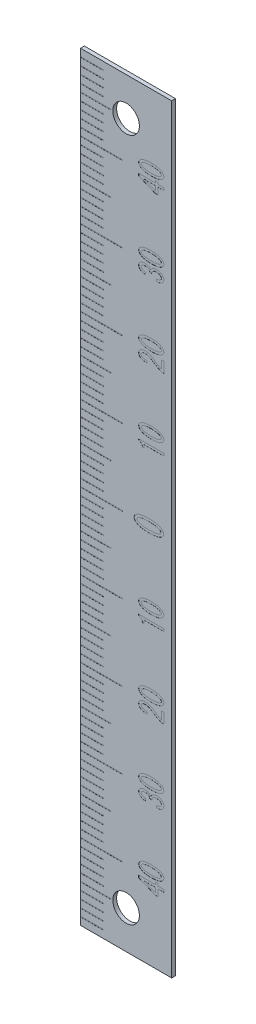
from build123d import *

# Parameters (mm, degrees)
SKETCH1_W      = 12
SKETCH1_H      = 100
EXTRUDE1_DEPTH = 0.5
SKETCH2_R      = 1.75
EXTRUDE2_DEPTH = 101.718667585
EXTRUDE3_DEPTH = 0.01
SKETCH4_W      = 3
SKETCH4_H      = 0.1
SKETCH4_W_2    = 4
SKETCH4_W_3    = 5.5
EXTRUDE4_DEPTH = 0.01


with BuildPart() as part:
    # Sketch1 → Extrude1 (new body)
    with BuildSketch(Plane.XY):
        with Locations((6, 50)):
            Rectangle(SKETCH1_W, SKETCH1_H)
    extrude(amount=EXTRUDE1_DEPTH)

    # Sketch2 → Extrude2 (cut, through all)
    with BuildSketch(Plane.XY.offset(0.5)):
        with Locations((6, 5)):
            Circle(SKETCH2_R)
        with Locations((6, 95)):
            Circle(SKETCH2_R)
    extrude(amount=-EXTRUDE2_DEPTH, mode=Mode.SUBTRACT)

    # Sketch3 → Extrude3 (cut)
    # profile 1 of 17: a face of its own
    with BuildSketch(Plane.XY.offset(0.5)):
        Polygon((10.964202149, 89.253595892), (10.576078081, 89.253595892), (10.18481385, 89.253595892), (10.18481385, 88.358021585), (9.863889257, 88.358021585), (7.659495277, 89.263016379), (7.659495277, 89.57326442), (9.863889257, 89.57326442), (9.863889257, 89.857135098), (10.18481385, 89.857135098), (10.18481385, 89.57326442), (10.964202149, 89.57326442), align=None)
        Polygon((9.863889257, 89.253595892), (8.371684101, 89.253595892), (9.863889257, 88.655080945), align=None, mode=Mode.SUBTRACT)
    # profile 2 of 17: a face of its own
    with BuildSketch(Plane.XY.offset(0.5)):
        with BuildLine():
            add(Edge.make_bspline(
                [(9.304312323, 90.08636695), (9.263487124, 90.086598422), (9.183284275, 90.087053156), (9.065184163, 90.090916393), (8.951677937, 90.097059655), (8.842790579, 90.105920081), (8.738418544, 90.116877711), (8.638826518, 90.131643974), (8.543659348, 90.147711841), (8.453367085, 90.166540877), (8.367534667, 90.187646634), (8.286660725, 90.212475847), (8.209981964, 90.238496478), (8.13792646, 90.267351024), (8.071052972, 90.299483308), (8.008231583, 90.333293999), (7.950513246, 90.370357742), (7.914537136, 90.397244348), (7.896891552, 90.410431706)],
                knots=[0, 0, 0, 0, 1.334199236, 2.621091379, 3.861325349, 5.048806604, 6.191184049, 7.29033474, 8.338632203, 9.344988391, 10.304094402, 11.226124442, 12.10888774, 12.949942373, 13.760906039, 14.53244093, 15.280190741, 16, 16, 16, 16], degree=3))
            add(Edge.make_bspline(
                [(7.896891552, 90.410431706), (7.877886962, 90.425936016), (7.841081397, 90.455962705), (7.793642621, 90.506288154), (7.75209867, 90.556343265), (7.718531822, 90.608467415), (7.691781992, 90.661574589), (7.673561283, 90.716630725), (7.661657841, 90.77250316), (7.660214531, 90.810429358), (7.659495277, 90.829329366)],
                knots=[0, 0, 0, 0, 1.179273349, 2.283859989, 3.322502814, 4.306324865, 5.261663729, 6.17616916, 7.091118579, 8, 8, 8, 8], degree=3))
            add(Edge.make_bspline(
                [(7.659495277, 90.829329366), (7.660212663, 90.848230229), (7.661652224, 90.886158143), (7.67358392, 90.942017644), (7.691636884, 90.996945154), (7.718688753, 91.049705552), (7.752296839, 91.101723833), (7.793217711, 91.152330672), (7.841340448, 91.202029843), (7.877935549, 91.232049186), (7.896891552, 91.247598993)],
                knots=[0, 0, 0, 0, 0.909839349, 1.825753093, 2.741222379, 3.688535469, 4.673394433, 5.720979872, 6.819483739, 8, 8, 8, 8], degree=3))
            add(Edge.make_bspline(
                [(7.896891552, 91.247598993), (7.914537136, 91.260786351), (7.950513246, 91.287672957), (8.008231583, 91.3247367), (8.071052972, 91.358547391), (8.13792646, 91.390679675), (8.209981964, 91.419534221), (8.286660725, 91.445554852), (8.367534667, 91.470384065), (8.453367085, 91.491489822), (8.543659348, 91.510318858), (8.638826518, 91.526386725), (8.738418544, 91.541152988), (8.842790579, 91.552110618), (8.951677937, 91.560971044), (9.065184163, 91.567114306), (9.183284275, 91.570977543), (9.263487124, 91.571432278), (9.304312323, 91.571663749)],
                knots=[0, 0, 0, 0, 0.719809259, 1.46755907, 2.239093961, 3.050057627, 3.89111226, 4.773875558, 5.695905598, 6.655011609, 7.661367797, 8.70966526, 9.808815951, 10.951193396, 12.138674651, 13.378908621, 14.665800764, 16, 16, 16, 16], degree=3))
            add(Edge.make_bspline(
                [(9.304312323, 91.571663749), (9.345974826, 91.571432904), (9.427642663, 91.570980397), (9.547627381, 91.567132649), (9.662805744, 91.560946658), (9.773365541, 91.552091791), (9.879218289, 91.541255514), (9.980042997, 91.52631378), (10.076267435, 91.510328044), (10.167806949, 91.49146689), (10.25471717, 91.470480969), (10.336402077, 91.445542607), (10.413707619, 91.419531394), (10.486394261, 91.390685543), (10.553875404, 91.358519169), (10.617234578, 91.324907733), (10.675058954, 91.28765614), (10.711041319, 91.260780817), (10.728689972, 91.247598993)],
                knots=[0, 0, 0, 0, 1.346341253, 2.639130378, 3.8790076, 5.073442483, 6.223226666, 7.316783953, 8.366697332, 9.375051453, 10.336565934, 11.254764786, 12.134057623, 12.971986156, 13.779994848, 14.548849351, 15.288238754, 16, 16, 16, 16], degree=3))
            add(Edge.make_bspline(
                [(10.728689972, 91.247598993), (10.747351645, 91.231964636), (10.783604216, 91.201592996), (10.832476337, 91.152791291), (10.872490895, 91.101447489), (10.906527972, 91.049937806), (10.932289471, 90.996615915), (10.951811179, 90.942259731), (10.962410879, 90.886054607), (10.964024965, 90.848209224), (10.964830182, 90.829329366)],
                knots=[0, 0, 0, 0, 1.1743338, 2.28128622, 3.323893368, 4.309986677, 5.254013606, 6.173907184, 7.08902033, 8, 8, 8, 8], degree=3))
            add(Edge.make_bspline(
                [(10.964830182, 90.829329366), (10.964023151, 90.81045032), (10.962405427, 90.772606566), (10.95183315, 90.716389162), (10.932141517, 90.661902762), (10.906685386, 90.608236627), (10.872691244, 90.556620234), (10.832051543, 90.505827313), (10.783860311, 90.456400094), (10.747399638, 90.426020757), (10.728689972, 90.410431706)],
                knots=[0, 0, 0, 0, 0.910025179, 1.824179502, 2.743109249, 3.69522398, 4.680284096, 5.713901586, 6.826896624, 8, 8, 8, 8], degree=3))
            add(Edge.make_bspline(
                [(10.728689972, 90.410431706), (10.711041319, 90.397249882), (10.675058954, 90.370374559), (10.617234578, 90.333122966), (10.553875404, 90.29951153), (10.486394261, 90.267345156), (10.413707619, 90.238499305), (10.336402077, 90.212488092), (10.25471717, 90.18754973), (10.167806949, 90.166563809), (10.076267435, 90.147702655), (9.980042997, 90.131716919), (9.879218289, 90.116775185), (9.773365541, 90.105938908), (9.662805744, 90.097084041), (9.547627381, 90.09089805), (9.427642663, 90.087050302), (9.345974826, 90.086597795), (9.304312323, 90.08636695)],
                knots=[0, 0, 0, 0, 0.711761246, 1.451150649, 2.220005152, 3.028013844, 3.865942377, 4.745235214, 5.663434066, 6.624948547, 7.633302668, 8.683216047, 9.776773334, 10.926557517, 12.1209924, 13.360869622, 14.653658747, 16, 16, 16, 16], degree=3))
        make_face()
        with BuildLine():
            add(Edge.make_bspline(
                [(9.304312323, 91.261415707), (9.267676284, 91.261069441), (9.195861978, 91.260390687), (9.090316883, 91.258165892), (8.989150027, 91.253278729), (8.892481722, 91.245290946), (8.80022693, 91.237179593), (8.712814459, 91.225295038), (8.629718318, 91.213328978), (8.551258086, 91.197943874), (8.47692929, 91.181420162), (8.407398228, 91.16150603), (8.341873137, 91.141413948), (8.281453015, 91.117852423), (8.225379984, 91.092883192), (8.173815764, 91.065786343), (8.126168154, 91.037204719), (8.097468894, 91.015283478), (8.083417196, 91.004550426)],
                knots=[0, 0, 0, 0, 1.387476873, 2.71974516, 3.997715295, 5.222316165, 6.392993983, 7.5041764, 8.562605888, 9.571696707, 10.531368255, 11.445041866, 12.310057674, 13.125709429, 13.899281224, 14.633331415, 15.330853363, 16, 16, 16, 16], degree=3))
            add(Edge.make_bspline(
                [(8.083417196, 91.004550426), (8.067942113, 90.991309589), (8.038992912, 90.966539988), (8.006840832, 90.922559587), (7.985224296, 90.87705391), (7.982844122, 90.845041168), (7.981675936, 90.829329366)],
                knots=[0, 0, 0, 0, 1.162721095, 2.175099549, 3.10434177, 4, 4, 4, 4], degree=3))
            add(Edge.make_bspline(
                [(7.981675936, 90.829329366), (7.982836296, 90.813611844), (7.985200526, 90.781587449), (8.007018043, 90.736019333), (8.038753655, 90.691521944), (8.067903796, 90.666693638), (8.083417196, 90.653480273)],
                knots=[0, 0, 0, 0, 0.893494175, 1.820491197, 2.840088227, 4, 4, 4, 4], degree=3))
            add(Edge.make_bspline(
                [(8.083417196, 90.653480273), (8.098156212, 90.643035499), (8.128454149, 90.621564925), (8.177291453, 90.592299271), (8.230299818, 90.565060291), (8.287887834, 90.540907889), (8.349363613, 90.517529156), (8.415145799, 90.496237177), (8.485227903, 90.477516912), (8.559390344, 90.460570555), (8.637959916, 90.445608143), (8.720652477, 90.432335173), (8.807623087, 90.421817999), (8.898748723, 90.413272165), (8.994176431, 90.405404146), (9.093874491, 90.400498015), (9.197746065, 90.398267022), (9.268304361, 90.397589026), (9.304312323, 90.397243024)],
                knots=[0, 0, 0, 0, 0.684573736, 1.407229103, 2.156074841, 2.941731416, 3.772993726, 4.648817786, 5.561264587, 6.521855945, 7.531913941, 8.592575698, 9.69595549, 10.851956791, 12.06190895, 13.325252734, 14.634998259, 16, 16, 16, 16], degree=3))
            add(Edge.make_bspline(
                [(9.304312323, 90.397243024), (9.341785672, 90.397588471), (9.415065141, 90.398263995), (9.522703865, 90.400490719), (9.625541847, 90.405385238), (9.723691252, 90.413273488), (9.817323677, 90.421841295), (9.906404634, 90.432229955), (9.990753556, 90.445635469), (10.070391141, 90.460491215), (10.145369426, 90.477539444), (10.215901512, 90.496147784), (10.281702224, 90.517419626), (10.342729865, 90.540898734), (10.399661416, 90.565104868), (10.451853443, 90.591966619), (10.49904188, 90.621590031), (10.528053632, 90.643045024), (10.542164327, 90.653480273)],
                knots=[0, 0, 0, 0, 1.401046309, 2.739758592, 4.0248449, 5.249399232, 6.420696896, 7.540008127, 8.601571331, 9.613140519, 10.568176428, 11.475655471, 12.339456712, 13.151990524, 13.919674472, 14.651282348, 15.344012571, 16, 16, 16, 16], degree=3))
            add(Edge.make_bspline(
                [(10.542164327, 90.653480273), (10.557596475, 90.666746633), (10.586687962, 90.691755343), (10.619429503, 90.735654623), (10.640196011, 90.781762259), (10.642682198, 90.813642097), (10.643905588, 90.829329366)],
                knots=[0, 0, 0, 0, 1.159232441, 2.18529495, 3.107029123, 4, 4, 4, 4], degree=3))
            add(Edge.make_bspline(
                [(10.643905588, 90.829329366), (10.642674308, 90.845010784), (10.640172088, 90.876878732), (10.619603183, 90.922925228), (10.586449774, 90.966304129), (10.557558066, 90.991255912), (10.542164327, 91.004550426)],
                knots=[0, 0, 0, 0, 0.89511734, 1.819067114, 2.837981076, 4, 4, 4, 4], degree=3))
            add(Edge.make_bspline(
                [(10.542164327, 91.004550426), (10.528109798, 91.015278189), (10.499404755, 91.037188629), (10.45164342, 91.065951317), (10.399548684, 91.092855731), (10.342868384, 91.117856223), (10.281814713, 91.14140776), (10.215668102, 91.161504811), (10.14550559, 91.181409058), (10.070358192, 91.198018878), (9.990830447, 91.213306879), (9.906283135, 91.225349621), (9.817389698, 91.237124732), (9.72367965, 91.245296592), (9.625545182, 91.253298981), (9.522702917, 91.258160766), (9.415065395, 91.26039668), (9.341785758, 91.261070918), (9.304312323, 91.261415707)],
                knots=[0, 0, 0, 0, 0.660466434, 1.348940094, 2.080407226, 2.851088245, 3.663465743, 4.524722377, 5.434082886, 6.388935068, 7.400309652, 8.46048529, 9.580538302, 10.751610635, 11.975929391, 13.260768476, 14.599223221, 16, 16, 16, 16], degree=3))
        make_face(mode=Mode.SUBTRACT)
    # profile 3 of 17: a face of its own
    with BuildSketch(Plane.XY.offset(0.5)):
        with BuildLine():
            add(Edge.make_bspline(
                [(9.982587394, 78.709091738), (10.012525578, 78.708287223), (10.070543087, 78.706728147), (10.154420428, 78.710760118), (10.232130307, 78.718455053), (10.303298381, 78.73168567), (10.368273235, 78.749141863), (10.427053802, 78.770782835), (10.479378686, 78.79791141), (10.510164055, 78.820091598), (10.525207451, 78.830930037)],
                knots=[0, 0, 0, 0, 1.267087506, 2.455501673, 3.55133733, 4.569646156, 5.515332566, 6.395721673, 7.21606285, 8, 8, 8, 8], degree=3))
            add(Edge.make_bspline(
                [(10.525207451, 78.830930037), (10.543506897, 78.847280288), (10.579345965, 78.8793019), (10.617183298, 78.941459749), (10.639871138, 79.011713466), (10.642530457, 79.061449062), (10.643905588, 79.087167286)],
                knots=[0, 0, 0, 0, 1.002413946, 1.963205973, 2.946775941, 4, 4, 4, 4], degree=3))
            add(Edge.make_bspline(
                [(10.643905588, 79.087167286), (10.64205895, 79.10966892), (10.638250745, 79.15607263), (10.60631016, 79.222801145), (10.557507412, 79.287350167), (10.514319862, 79.324320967), (10.491293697, 79.344032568)],
                knots=[0, 0, 0, 0, 0.87119639, 1.796613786, 2.82522778, 4, 4, 4, 4], degree=3))
            add(Edge.make_bspline(
                [(10.491293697, 79.344032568), (10.477715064, 79.35383947), (10.449615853, 79.374133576), (10.40102721, 79.398039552), (10.347048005, 79.41973801), (10.286272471, 79.436247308), (10.219328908, 79.449449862), (10.146079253, 79.458528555), (10.066417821, 79.464292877), (10.011278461, 79.464917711), (9.982587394, 79.465242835)],
                knots=[0, 0, 0, 0, 0.754595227, 1.561536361, 2.43511806, 3.377163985, 4.397951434, 5.512234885, 6.705522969, 8, 8, 8, 8], degree=3))
            add(Edge.make_bspline(
                [(9.982587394, 79.465242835), (9.960377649, 79.46473344), (9.916687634, 79.463731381), (9.85267071, 79.456647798), (9.791236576, 79.44559945), (9.732735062, 79.428991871), (9.676430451, 79.40846888), (9.623062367, 79.382368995), (9.571883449, 79.352579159), (9.540443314, 79.328863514), (9.524751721, 79.317027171)],
                knots=[0, 0, 0, 0, 1.086352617, 2.137024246, 3.147391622, 4.136355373, 5.10847195, 6.074961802, 7.039224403, 8, 8, 8, 8], degree=3))
            add(Edge.make_bspline(
                [(9.524751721, 79.317027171), (9.514022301, 79.307663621), (9.492758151, 79.289106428), (9.465670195, 79.256771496), (9.44319759, 79.221167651), (9.426529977, 79.181802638), (9.413593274, 79.139332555), (9.406578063, 79.093273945), (9.403067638, 79.044064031), (9.405038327, 79.010337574), (9.406053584, 78.992962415)],
                knots=[0, 0, 0, 0, 0.947861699, 1.87852391, 2.799832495, 3.743268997, 4.71875736, 5.750864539, 6.841292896, 8, 8, 8, 8], degree=3))
            Line((9.406053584, 78.992962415), (9.117786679, 78.992962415))
            add(Edge.make_bspline(
                [(9.117786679, 78.992962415), (9.115917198, 79.01036469), (9.11227151, 79.044300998), (9.103170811, 79.09366086), (9.089082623, 79.139312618), (9.072365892, 79.182135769), (9.050836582, 79.220887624), (9.026138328, 79.256550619), (8.997813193, 79.288974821), (8.976089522, 79.307646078), (8.965174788, 79.317027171)],
                knots=[0, 0, 0, 0, 1.139052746, 2.221275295, 3.260086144, 4.244297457, 5.207730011, 6.137529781, 7.064229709, 8, 8, 8, 8], degree=3))
            add(Edge.make_bspline(
                [(8.965174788, 79.317027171), (8.953430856, 79.325692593), (8.929384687, 79.343435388), (8.888683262, 79.365118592), (8.844024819, 79.38418922), (8.794826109, 79.398815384), (8.741812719, 79.411043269), (8.684417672, 79.41879032), (8.62278159, 79.423939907), (8.580202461, 79.42467109), (8.558209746, 79.425048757)],
                knots=[0, 0, 0, 0, 0.816014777, 1.670822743, 2.574059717, 3.530392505, 4.539613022, 5.616822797, 6.769055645, 8, 8, 8, 8], degree=3))
            add(Edge.make_bspline(
                [(8.558209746, 79.425048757), (8.530985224, 79.424710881), (8.478357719, 79.424057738), (8.402231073, 79.418395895), (8.331762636, 79.409047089), (8.266898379, 79.396390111), (8.208285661, 79.3784051), (8.154956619, 79.358063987), (8.10766056, 79.33316966), (8.079858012, 79.312952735), (8.06646032, 79.303210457)],
                knots=[0, 0, 0, 0, 1.267211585, 2.44963652, 3.550842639, 4.575246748, 5.5217347, 6.401234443, 7.229575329, 8, 8, 8, 8], degree=3))
            add(Edge.make_bspline(
                [(8.06646032, 79.303210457), (8.050800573, 79.289680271), (8.020516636, 79.263514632), (7.989112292, 79.21338768), (7.967772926, 79.159180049), (7.965751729, 79.120663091), (7.964719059, 79.100984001)],
                knots=[0, 0, 0, 0, 1.053722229, 2.037763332, 2.997453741, 4, 4, 4, 4], degree=3))
            add(Edge.make_bspline(
                [(7.964719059, 79.100984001), (7.965793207, 79.081323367), (7.967906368, 79.0426452), (7.988749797, 78.988170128), (8.020925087, 78.938367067), (8.050860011, 78.911914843), (8.06646032, 78.898129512)],
                knots=[0, 0, 0, 0, 1.000412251, 1.968100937, 2.94109465, 4, 4, 4, 4], degree=3))
            add(Edge.make_bspline(
                [(8.06646032, 78.898129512), (8.081277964, 78.887055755), (8.111428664, 78.864523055), (8.162612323, 78.837488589), (8.218046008, 78.812216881), (8.279698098, 78.793150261), (8.345928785, 78.775455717), (8.417710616, 78.763754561), (8.494531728, 78.75366975), (8.547707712, 78.75119286), (8.575166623, 78.749913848)],
                knots=[0, 0, 0, 0, 0.823448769, 1.675540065, 2.573857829, 3.535986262, 4.547798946, 5.627975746, 6.775138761, 8, 8, 8, 8], degree=3))
            Line((8.575166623, 78.749913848), (8.575166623, 78.452854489))
            add(Edge.make_bspline(
                [(8.575166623, 78.452854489), (8.539320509, 78.454383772), (8.469081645, 78.457380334), (8.36662153, 78.471341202), (8.269148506, 78.489228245), (8.177509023, 78.515831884), (8.090488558, 78.54647123), (8.009243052, 78.585395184), (7.932662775, 78.629471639), (7.886090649, 78.664635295), (7.862977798, 78.682086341)],
                knots=[0, 0, 0, 0, 1.130465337, 2.215096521, 3.257023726, 4.251490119, 5.220175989, 6.161913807, 7.087793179, 8, 8, 8, 8], degree=3))
            add(Edge.make_bspline(
                [(7.862977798, 78.682086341), (7.8467956, 78.695809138), (7.81513049, 78.722661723), (7.772968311, 78.767477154), (7.738724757, 78.816404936), (7.709237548, 78.867139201), (7.68725208, 78.92158891), (7.670766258, 78.978543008), (7.661240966, 79.038909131), (7.660084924, 79.080016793), (7.659495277, 79.100984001)],
                knots=[0, 0, 0, 0, 1.054146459, 2.062739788, 3.04727221, 4.0164563, 4.972878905, 5.957576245, 6.958249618, 8, 8, 8, 8], degree=3))
            add(Edge.make_bspline(
                [(7.659495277, 79.100984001), (7.660084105, 79.122995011), (7.661233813, 79.165972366), (7.67065538, 79.228867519), (7.687412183, 79.288028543), (7.708926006, 79.344536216), (7.738532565, 79.396768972), (7.773183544, 79.446397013), (7.814699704, 79.492477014), (7.846729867, 79.519408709), (7.862977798, 79.533070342)],
                knots=[0, 0, 0, 0, 1.066551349, 2.082482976, 3.072030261, 4.042353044, 5.005167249, 5.973525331, 6.972030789, 8, 8, 8, 8], degree=3))
            add(Edge.make_bspline(
                [(7.862977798, 79.533070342), (7.883180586, 79.548391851), (7.923800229, 79.579197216), (7.99101211, 79.617407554), (8.063031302, 79.649133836), (8.139054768, 79.676462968), (8.220201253, 79.697274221), (8.306188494, 79.711237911), (8.396823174, 79.720285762), (8.458748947, 79.721491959), (8.490382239, 79.722108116)],
                knots=[0, 0, 0, 0, 0.910342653, 1.830331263, 2.769796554, 3.735781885, 4.730142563, 5.775142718, 6.863485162, 8, 8, 8, 8], degree=3))
            add(Edge.make_bspline(
                [(8.490382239, 79.722108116), (8.519286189, 79.72161156), (8.575295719, 79.720649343), (8.656472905, 79.713669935), (8.732474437, 79.70249683), (8.803229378, 79.686672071), (8.868446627, 79.664650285), (8.928974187, 79.640082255), (8.984286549, 79.610093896), (9.016949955, 79.585400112), (9.033002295, 79.57326442)],
                knots=[0, 0, 0, 0, 1.210143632, 2.344993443, 3.40861805, 4.424997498, 5.37575867, 6.287368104, 7.158331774, 8, 8, 8, 8], degree=3))
            add(Edge.make_bspline(
                [(9.033002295, 79.57326442), (9.059175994, 79.551536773), (9.108490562, 79.51059913), (9.171793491, 79.445781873), (9.221317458, 79.38266922), (9.243208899, 79.337936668), (9.253441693, 79.317027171)],
                knots=[0, 0, 0, 0, 1.195517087, 2.252505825, 3.183162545, 4, 4, 4, 4], degree=3))
            add(Edge.make_bspline(
                [(9.253441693, 79.317027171), (9.265088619, 79.34500906), (9.287538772, 79.398945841), (9.331763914, 79.47199791), (9.381380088, 79.535717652), (9.420772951, 79.570253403), (9.439967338, 79.587081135)],
                knots=[0, 0, 0, 0, 1.094399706, 2.109521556, 3.078854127, 4, 4, 4, 4], degree=3))
            add(Edge.make_bspline(
                [(9.439967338, 79.587081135), (9.459994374, 79.60234586), (9.499821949, 79.632702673), (9.564355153, 79.670989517), (9.632227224, 79.703077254), (9.702874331, 79.730156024), (9.776856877, 79.751027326), (9.854027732, 79.765256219), (9.934226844, 79.774233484), (9.988843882, 79.775485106), (10.016501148, 79.776118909)],
                knots=[0, 0, 0, 0, 0.976244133, 1.941447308, 2.904084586, 3.885987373, 4.873249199, 5.881498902, 6.927222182, 8, 8, 8, 8], degree=3))
            add(Edge.make_bspline(
                [(10.016501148, 79.776118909), (10.052324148, 79.77559206), (10.122443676, 79.774560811), (10.225084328, 79.764261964), (10.322576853, 79.747624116), (10.414506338, 79.72361205), (10.501245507, 79.69357359), (10.582537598, 79.656250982), (10.659144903, 79.612707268), (10.705595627, 79.577553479), (10.728689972, 79.560075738)],
                knots=[0, 0, 0, 0, 1.13285732, 2.217441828, 3.259318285, 4.258350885, 5.219645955, 6.158999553, 7.084692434, 8, 8, 8, 8], degree=3))
            add(Edge.make_bspline(
                [(10.728689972, 79.560075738), (10.747408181, 79.544073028), (10.784031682, 79.512762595), (10.832853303, 79.461250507), (10.873280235, 79.40591535), (10.906871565, 79.348128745), (10.932721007, 79.287091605), (10.951971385, 79.223397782), (10.962541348, 79.156184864), (10.964058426, 79.110438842), (10.964830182, 79.087167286)],
                knots=[0, 0, 0, 0, 1.078182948, 2.109541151, 3.099814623, 4.073306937, 5.030426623, 5.996463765, 6.980776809, 8, 8, 8, 8], degree=3))
            add(Edge.make_bspline(
                [(10.964830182, 79.087167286), (10.964367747, 79.062001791), (10.963461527, 79.012685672), (10.952274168, 78.941195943), (10.935512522, 78.873719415), (10.911441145, 78.810497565), (10.88066456, 78.751121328), (10.842591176, 78.696168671), (10.797876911, 78.645289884), (10.763207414, 78.615937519), (10.745646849, 78.601070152)],
                knots=[0, 0, 0, 0, 1.091653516, 2.139282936, 3.133504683, 4.105839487, 5.069340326, 6.029921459, 7.002128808, 8, 8, 8, 8], degree=3))
            add(Edge.make_bspline(
                [(10.745646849, 78.601070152), (10.723356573, 78.584883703), (10.677849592, 78.551838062), (10.601818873, 78.510403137), (10.51783525, 78.476087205), (10.426096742, 78.448030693), (10.326687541, 78.425207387), (10.21890008, 78.410072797), (10.103344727, 78.400491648), (10.023639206, 78.399403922), (9.982587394, 78.398843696)],
                knots=[0, 0, 0, 0, 0.821972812, 1.678108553, 2.577822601, 3.526913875, 4.539938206, 5.620279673, 6.774340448, 8, 8, 8, 8], degree=3))
            Line((9.982587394, 78.398843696), (9.982587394, 78.709091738))
        make_face()
    # profile 4 of 17: a face of its own
    with BuildSketch(Plane.XY.offset(0.5)):
        with BuildLine():
            add(Edge.make_bspline(
                [(9.304312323, 80.08636695), (9.263487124, 80.086598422), (9.183284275, 80.087053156), (9.065184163, 80.090916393), (8.951677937, 80.097059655), (8.842790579, 80.105920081), (8.738418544, 80.116877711), (8.638826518, 80.131643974), (8.543659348, 80.147711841), (8.453367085, 80.166540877), (8.367534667, 80.187646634), (8.286660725, 80.212475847), (8.209981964, 80.238496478), (8.13792646, 80.267351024), (8.071052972, 80.299483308), (8.008231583, 80.333293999), (7.950513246, 80.370357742), (7.914537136, 80.397244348), (7.896891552, 80.410431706)],
                knots=[0, 0, 0, 0, 1.334199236, 2.621091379, 3.861325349, 5.048806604, 6.191184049, 7.29033474, 8.338632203, 9.344988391, 10.304094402, 11.226124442, 12.10888774, 12.949942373, 13.760906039, 14.53244093, 15.280190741, 16, 16, 16, 16], degree=3))
            add(Edge.make_bspline(
                [(7.896891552, 80.410431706), (7.877886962, 80.425936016), (7.841081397, 80.455962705), (7.793642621, 80.506288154), (7.75209867, 80.556343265), (7.718531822, 80.608467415), (7.691781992, 80.661574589), (7.673561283, 80.716630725), (7.661657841, 80.77250316), (7.660214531, 80.810429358), (7.659495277, 80.829329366)],
                knots=[0, 0, 0, 0, 1.179273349, 2.283859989, 3.322502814, 4.306324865, 5.261663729, 6.17616916, 7.091118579, 8, 8, 8, 8], degree=3))
            add(Edge.make_bspline(
                [(7.659495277, 80.829329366), (7.660212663, 80.848230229), (7.661652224, 80.886158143), (7.67358392, 80.942017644), (7.691636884, 80.996945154), (7.718688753, 81.049705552), (7.752296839, 81.101723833), (7.793217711, 81.152330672), (7.841340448, 81.202029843), (7.877935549, 81.232049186), (7.896891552, 81.247598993)],
                knots=[0, 0, 0, 0, 0.909839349, 1.825753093, 2.741222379, 3.688535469, 4.673394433, 5.720979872, 6.819483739, 8, 8, 8, 8], degree=3))
            add(Edge.make_bspline(
                [(7.896891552, 81.247598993), (7.914537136, 81.260786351), (7.950513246, 81.287672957), (8.008231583, 81.3247367), (8.071052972, 81.358547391), (8.13792646, 81.390679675), (8.209981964, 81.419534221), (8.286660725, 81.445554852), (8.367534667, 81.470384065), (8.453367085, 81.491489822), (8.543659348, 81.510318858), (8.638826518, 81.526386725), (8.738418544, 81.541152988), (8.842790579, 81.552110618), (8.951677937, 81.560971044), (9.065184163, 81.567114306), (9.183284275, 81.570977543), (9.263487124, 81.571432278), (9.304312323, 81.571663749)],
                knots=[0, 0, 0, 0, 0.719809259, 1.46755907, 2.239093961, 3.050057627, 3.89111226, 4.773875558, 5.695905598, 6.655011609, 7.661367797, 8.70966526, 9.808815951, 10.951193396, 12.138674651, 13.378908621, 14.665800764, 16, 16, 16, 16], degree=3))
            add(Edge.make_bspline(
                [(9.304312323, 81.571663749), (9.345974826, 81.571432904), (9.427642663, 81.570980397), (9.547627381, 81.567132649), (9.662805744, 81.560946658), (9.773365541, 81.552091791), (9.879218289, 81.541255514), (9.980042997, 81.52631378), (10.076267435, 81.510328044), (10.167806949, 81.49146689), (10.25471717, 81.470480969), (10.336402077, 81.445542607), (10.413707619, 81.419531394), (10.486394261, 81.390685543), (10.553875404, 81.358519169), (10.617234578, 81.324907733), (10.675058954, 81.28765614), (10.711041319, 81.260780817), (10.728689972, 81.247598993)],
                knots=[0, 0, 0, 0, 1.346341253, 2.639130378, 3.8790076, 5.073442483, 6.223226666, 7.316783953, 8.366697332, 9.375051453, 10.336565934, 11.254764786, 12.134057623, 12.971986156, 13.779994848, 14.548849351, 15.288238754, 16, 16, 16, 16], degree=3))
            add(Edge.make_bspline(
                [(10.728689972, 81.247598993), (10.747351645, 81.231964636), (10.783604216, 81.201592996), (10.832476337, 81.152791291), (10.872490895, 81.101447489), (10.906527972, 81.049937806), (10.932289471, 80.996615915), (10.951811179, 80.942259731), (10.962410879, 80.886054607), (10.964024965, 80.848209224), (10.964830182, 80.829329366)],
                knots=[0, 0, 0, 0, 1.1743338, 2.28128622, 3.323893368, 4.309986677, 5.254013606, 6.173907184, 7.08902033, 8, 8, 8, 8], degree=3))
            add(Edge.make_bspline(
                [(10.964830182, 80.829329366), (10.964023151, 80.81045032), (10.962405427, 80.772606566), (10.95183315, 80.716389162), (10.932141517, 80.661902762), (10.906685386, 80.608236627), (10.872691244, 80.556620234), (10.832051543, 80.505827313), (10.783860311, 80.456400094), (10.747399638, 80.426020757), (10.728689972, 80.410431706)],
                knots=[0, 0, 0, 0, 0.910025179, 1.824179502, 2.743109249, 3.69522398, 4.680284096, 5.713901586, 6.826896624, 8, 8, 8, 8], degree=3))
            add(Edge.make_bspline(
                [(10.728689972, 80.410431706), (10.711041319, 80.397249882), (10.675058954, 80.370374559), (10.617234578, 80.333122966), (10.553875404, 80.29951153), (10.486394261, 80.267345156), (10.413707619, 80.238499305), (10.336402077, 80.212488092), (10.25471717, 80.18754973), (10.167806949, 80.166563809), (10.076267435, 80.147702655), (9.980042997, 80.131716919), (9.879218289, 80.116775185), (9.773365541, 80.105938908), (9.662805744, 80.097084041), (9.547627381, 80.09089805), (9.427642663, 80.087050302), (9.345974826, 80.086597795), (9.304312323, 80.08636695)],
                knots=[0, 0, 0, 0, 0.711761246, 1.451150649, 2.220005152, 3.028013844, 3.865942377, 4.745235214, 5.663434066, 6.624948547, 7.633302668, 8.683216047, 9.776773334, 10.926557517, 12.1209924, 13.360869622, 14.653658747, 16, 16, 16, 16], degree=3))
        make_face()
        with BuildLine():
            add(Edge.make_bspline(
                [(9.304312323, 81.261415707), (9.267676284, 81.261069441), (9.195861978, 81.260390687), (9.090316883, 81.258165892), (8.989150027, 81.253278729), (8.892481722, 81.245290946), (8.80022693, 81.237179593), (8.712814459, 81.225295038), (8.629718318, 81.213328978), (8.551258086, 81.197943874), (8.47692929, 81.181420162), (8.407398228, 81.16150603), (8.341873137, 81.141413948), (8.281453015, 81.117852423), (8.225379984, 81.092883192), (8.173815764, 81.065786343), (8.126168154, 81.037204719), (8.097468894, 81.015283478), (8.083417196, 81.004550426)],
                knots=[0, 0, 0, 0, 1.387476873, 2.71974516, 3.997715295, 5.222316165, 6.392993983, 7.5041764, 8.562605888, 9.571696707, 10.531368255, 11.445041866, 12.310057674, 13.125709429, 13.899281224, 14.633331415, 15.330853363, 16, 16, 16, 16], degree=3))
            add(Edge.make_bspline(
                [(8.083417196, 81.004550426), (8.067942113, 80.991309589), (8.038992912, 80.966539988), (8.006840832, 80.922559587), (7.985224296, 80.87705391), (7.982844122, 80.845041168), (7.981675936, 80.829329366)],
                knots=[0, 0, 0, 0, 1.162721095, 2.175099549, 3.10434177, 4, 4, 4, 4], degree=3))
            add(Edge.make_bspline(
                [(7.981675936, 80.829329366), (7.982836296, 80.813611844), (7.985200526, 80.781587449), (8.007018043, 80.736019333), (8.038753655, 80.691521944), (8.067903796, 80.666693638), (8.083417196, 80.653480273)],
                knots=[0, 0, 0, 0, 0.893494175, 1.820491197, 2.840088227, 4, 4, 4, 4], degree=3))
            add(Edge.make_bspline(
                [(8.083417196, 80.653480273), (8.098156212, 80.643035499), (8.128454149, 80.621564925), (8.177291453, 80.592299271), (8.230299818, 80.565060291), (8.287887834, 80.540907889), (8.349363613, 80.517529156), (8.415145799, 80.496237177), (8.485227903, 80.477516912), (8.559390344, 80.460570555), (8.637959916, 80.445608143), (8.720652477, 80.432335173), (8.807623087, 80.421817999), (8.898748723, 80.413272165), (8.994176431, 80.405404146), (9.093874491, 80.400498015), (9.197746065, 80.398267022), (9.268304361, 80.397589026), (9.304312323, 80.397243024)],
                knots=[0, 0, 0, 0, 0.684573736, 1.407229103, 2.156074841, 2.941731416, 3.772993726, 4.648817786, 5.561264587, 6.521855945, 7.531913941, 8.592575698, 9.69595549, 10.851956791, 12.06190895, 13.325252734, 14.634998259, 16, 16, 16, 16], degree=3))
            add(Edge.make_bspline(
                [(9.304312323, 80.397243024), (9.341785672, 80.397588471), (9.415065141, 80.398263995), (9.522703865, 80.400490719), (9.625541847, 80.405385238), (9.723691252, 80.413273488), (9.817323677, 80.421841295), (9.906404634, 80.432229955), (9.990753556, 80.445635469), (10.070391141, 80.460491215), (10.145369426, 80.477539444), (10.215901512, 80.496147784), (10.281702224, 80.517419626), (10.342729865, 80.540898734), (10.399661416, 80.565104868), (10.451853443, 80.591966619), (10.49904188, 80.621590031), (10.528053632, 80.643045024), (10.542164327, 80.653480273)],
                knots=[0, 0, 0, 0, 1.401046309, 2.739758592, 4.0248449, 5.249399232, 6.420696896, 7.540008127, 8.601571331, 9.613140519, 10.568176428, 11.475655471, 12.339456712, 13.151990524, 13.919674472, 14.651282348, 15.344012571, 16, 16, 16, 16], degree=3))
            add(Edge.make_bspline(
                [(10.542164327, 80.653480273), (10.557596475, 80.666746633), (10.586687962, 80.691755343), (10.619429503, 80.735654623), (10.640196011, 80.781762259), (10.642682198, 80.813642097), (10.643905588, 80.829329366)],
                knots=[0, 0, 0, 0, 1.159232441, 2.18529495, 3.107029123, 4, 4, 4, 4], degree=3))
            add(Edge.make_bspline(
                [(10.643905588, 80.829329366), (10.642674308, 80.845010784), (10.640172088, 80.876878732), (10.619603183, 80.922925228), (10.586449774, 80.966304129), (10.557558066, 80.991255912), (10.542164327, 81.004550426)],
                knots=[0, 0, 0, 0, 0.89511734, 1.819067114, 2.837981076, 4, 4, 4, 4], degree=3))
            add(Edge.make_bspline(
                [(10.542164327, 81.004550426), (10.528109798, 81.015278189), (10.499404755, 81.037188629), (10.45164342, 81.065951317), (10.399548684, 81.092855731), (10.342868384, 81.117856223), (10.281814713, 81.14140776), (10.215668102, 81.161504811), (10.14550559, 81.181409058), (10.070358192, 81.198018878), (9.990830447, 81.213306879), (9.906283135, 81.225349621), (9.817389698, 81.237124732), (9.72367965, 81.245296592), (9.625545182, 81.253298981), (9.522702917, 81.258160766), (9.415065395, 81.26039668), (9.341785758, 81.261070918), (9.304312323, 81.261415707)],
                knots=[0, 0, 0, 0, 0.660466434, 1.348940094, 2.080407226, 2.851088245, 3.663465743, 4.524722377, 5.434082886, 6.388935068, 7.400309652, 8.46048529, 9.580538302, 10.751610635, 11.975929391, 13.260768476, 14.599223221, 16, 16, 16, 16], degree=3))
        make_face(mode=Mode.SUBTRACT)
    # profile 5 of 17: a face of its own
    with BuildSketch(Plane.XY.offset(0.5)):
        with BuildLine():
            Line((10.643905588, 69.789307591), (10.964830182, 69.789307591))
            Line((10.964830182, 69.789307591), (10.964830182, 68.412032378))
            Line((10.964830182, 68.412032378), (10.694776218, 68.412032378))
            add(Edge.make_bspline(
                [(10.694776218, 68.412032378), (10.634104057, 68.438239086), (10.512820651, 68.490626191), (10.333941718, 68.576059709), (10.15666089, 68.664824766), (9.982086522, 68.759401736), (9.809323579, 68.858008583), (9.638392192, 68.960822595), (9.469988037, 69.068963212), (9.359615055, 69.144268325), (9.304312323, 69.18200019)],
                knots=[0, 0, 0, 0, 0.99614483, 1.991289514, 2.987624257, 3.984438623, 4.983697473, 5.985971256, 6.990864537, 8, 8, 8, 8], degree=3))
            add(Edge.make_bspline(
                [(9.304312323, 69.18200019), (9.273407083, 69.202561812), (9.212458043, 69.24311193), (9.117211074, 69.295150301), (9.021104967, 69.339278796), (8.923672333, 69.375332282), (8.825440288, 69.4035815), (8.72593849, 69.42388529), (8.625513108, 69.436178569), (8.558034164, 69.437551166), (8.524295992, 69.438237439)],
                knots=[0, 0, 0, 0, 1.067918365, 2.106070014, 3.119789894, 4.109153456, 5.093164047, 6.058534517, 7.029304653, 8, 8, 8, 8], degree=3))
            add(Edge.make_bspline(
                [(8.524295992, 69.438237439), (8.501046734, 69.437894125), (8.455732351, 69.437224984), (8.389860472, 69.431518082), (8.328132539, 69.422267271), (8.270797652, 69.409104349), (8.21743613, 69.392320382), (8.168710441, 69.370724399), (8.123431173, 69.346637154), (8.096599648, 69.326782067), (8.083417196, 69.317027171)],
                knots=[0, 0, 0, 0, 1.197973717, 2.334932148, 3.404529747, 4.412096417, 5.3640046, 6.281988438, 7.155932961, 8, 8, 8, 8], degree=3))
            add(Edge.make_bspline(
                [(8.083417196, 69.317027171), (8.067746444, 69.303076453), (8.037248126, 69.275925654), (8.005254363, 69.223199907), (7.984772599, 69.164442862), (7.982726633, 69.122515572), (7.981675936, 69.100984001)],
                knots=[0, 0, 0, 0, 1.01321699, 1.971916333, 2.958486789, 4, 4, 4, 4], degree=3))
            add(Edge.make_bspline(
                [(7.981675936, 69.100984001), (7.983585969, 69.082717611), (7.987575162, 69.044567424), (8.01537348, 68.988943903), (8.059276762, 68.934674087), (8.097036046, 68.902326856), (8.11733095, 68.88494083)],
                knots=[0, 0, 0, 0, 0.831770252, 1.737190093, 2.783782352, 4, 4, 4, 4], degree=3))
            add(Edge.make_bspline(
                [(8.11733095, 68.88494083), (8.13152823, 68.875101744), (8.161915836, 68.854042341), (8.215884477, 68.829594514), (8.27953563, 68.808918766), (8.353234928, 68.792609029), (8.436819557, 68.778578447), (8.530630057, 68.769762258), (8.63433812, 68.764032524), (8.706835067, 68.763421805), (8.74473539, 68.76310253)],
                knots=[0, 0, 0, 0, 0.638255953, 1.36611168, 2.182006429, 3.11234378, 4.156826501, 5.317109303, 6.597424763, 8, 8, 8, 8], degree=3))
            Line((8.74473539, 68.76310253), (8.74473539, 68.466043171))
            add(Edge.make_bspline(
                [(8.74473539, 68.466043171), (8.695515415, 68.46790543), (8.600702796, 68.471492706), (8.463728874, 68.483794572), (8.337426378, 68.503038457), (8.221668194, 68.528812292), (8.116016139, 68.559516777), (8.021404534, 68.598268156), (7.936291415, 68.64179784), (7.886844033, 68.67828985), (7.862977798, 68.695903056)],
                knots=[0, 0, 0, 0, 1.276449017, 2.458828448, 3.562299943, 4.585123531, 5.530965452, 6.409552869, 7.23235602, 8, 8, 8, 8], degree=3))
            add(Edge.make_bspline(
                [(7.862977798, 68.695903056), (7.846729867, 68.709564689), (7.814699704, 68.736496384), (7.773183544, 68.782576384), (7.738532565, 68.832204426), (7.708926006, 68.884437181), (7.687412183, 68.940944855), (7.67065538, 69.000105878), (7.661233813, 69.063001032), (7.660084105, 69.105978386), (7.659495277, 69.127989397)],
                knots=[0, 0, 0, 0, 1.027969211, 2.026474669, 2.994832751, 3.957646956, 4.927969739, 5.917517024, 6.933448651, 8, 8, 8, 8], degree=3))
            add(Edge.make_bspline(
                [(7.659495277, 69.127989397), (7.659956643, 69.148979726), (7.660867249, 69.190408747), (7.672379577, 69.250967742), (7.688861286, 69.309450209), (7.71397118, 69.364787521), (7.74481477, 69.418042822), (7.782906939, 69.468678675), (7.828294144, 69.516390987), (7.862484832, 69.545314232), (7.879934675, 69.560075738)],
                knots=[0, 0, 0, 0, 1.000230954, 1.974175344, 2.932001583, 3.893571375, 4.865053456, 5.864036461, 6.909871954, 8, 8, 8, 8], degree=3))
            add(Edge.make_bspline(
                [(7.879934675, 69.560075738), (7.900321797, 69.575446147), (7.941611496, 69.606575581), (8.010569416, 69.644342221), (8.084899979, 69.676515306), (8.164800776, 69.703727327), (8.25083857, 69.724143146), (8.34261768, 69.738396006), (8.43996472, 69.747294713), (8.506900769, 69.748496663), (8.541252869, 69.749113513)],
                knots=[0, 0, 0, 0, 0.873404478, 1.768891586, 2.683909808, 3.645167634, 4.655436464, 5.707963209, 6.823708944, 8, 8, 8, 8], degree=3))
            add(Edge.make_bspline(
                [(8.541252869, 69.749113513), (8.5825466, 69.747997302), (8.665684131, 69.745750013), (8.7908176, 69.728176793), (8.916613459, 69.69873904), (9.043909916, 69.659401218), (9.171696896, 69.607206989), (9.300597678, 69.544064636), (9.430892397, 69.470149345), (9.515481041, 69.41326659), (9.558665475, 69.384226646)],
                knots=[0, 0, 0, 0, 0.902713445, 1.817451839, 2.756860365, 3.725448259, 4.727634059, 5.771721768, 6.862413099, 8, 8, 8, 8], degree=3))
            add(Edge.make_bspline(
                [(9.558665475, 69.384226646), (9.650692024, 69.32107194), (9.831341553, 69.197098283), (10.105692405, 69.027797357), (10.37414261, 68.87223849), (10.555117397, 68.780905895), (10.643905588, 68.736097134)],
                knots=[0, 0, 0, 0, 1.058433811, 2.077721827, 3.056909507, 4, 4, 4, 4], degree=3))
            Line((10.643905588, 68.736097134), (10.643905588, 69.789307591))
        make_face()
    # profile 6 of 17: a face of its own
    with BuildSketch(Plane.XY.offset(0.5)):
        with BuildLine():
            add(Edge.make_bspline(
                [(9.304312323, 70.08636695), (9.263487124, 70.086598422), (9.183284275, 70.087053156), (9.065184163, 70.090916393), (8.951677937, 70.097059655), (8.842790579, 70.105920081), (8.738418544, 70.116877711), (8.638826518, 70.131643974), (8.543659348, 70.147711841), (8.453367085, 70.166540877), (8.367534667, 70.187646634), (8.286660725, 70.212475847), (8.209981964, 70.238496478), (8.13792646, 70.267351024), (8.071052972, 70.299483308), (8.008231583, 70.333293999), (7.950513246, 70.370357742), (7.914537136, 70.397244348), (7.896891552, 70.410431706)],
                knots=[0, 0, 0, 0, 1.334199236, 2.621091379, 3.861325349, 5.048806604, 6.191184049, 7.29033474, 8.338632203, 9.344988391, 10.304094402, 11.226124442, 12.10888774, 12.949942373, 13.760906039, 14.53244093, 15.280190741, 16, 16, 16, 16], degree=3))
            add(Edge.make_bspline(
                [(7.896891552, 70.410431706), (7.877886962, 70.425936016), (7.841081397, 70.455962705), (7.793642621, 70.506288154), (7.75209867, 70.556343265), (7.718531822, 70.608467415), (7.691781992, 70.661574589), (7.673561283, 70.716630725), (7.661657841, 70.77250316), (7.660214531, 70.810429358), (7.659495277, 70.829329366)],
                knots=[0, 0, 0, 0, 1.179273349, 2.283859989, 3.322502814, 4.306324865, 5.261663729, 6.17616916, 7.091118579, 8, 8, 8, 8], degree=3))
            add(Edge.make_bspline(
                [(7.659495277, 70.829329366), (7.660212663, 70.848230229), (7.661652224, 70.886158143), (7.67358392, 70.942017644), (7.691636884, 70.996945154), (7.718688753, 71.049705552), (7.752296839, 71.101723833), (7.793217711, 71.152330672), (7.841340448, 71.202029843), (7.877935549, 71.232049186), (7.896891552, 71.247598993)],
                knots=[0, 0, 0, 0, 0.909839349, 1.825753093, 2.741222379, 3.688535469, 4.673394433, 5.720979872, 6.819483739, 8, 8, 8, 8], degree=3))
            add(Edge.make_bspline(
                [(7.896891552, 71.247598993), (7.914537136, 71.260786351), (7.950513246, 71.287672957), (8.008231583, 71.3247367), (8.071052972, 71.358547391), (8.13792646, 71.390679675), (8.209981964, 71.419534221), (8.286660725, 71.445554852), (8.367534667, 71.470384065), (8.453367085, 71.491489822), (8.543659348, 71.510318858), (8.638826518, 71.526386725), (8.738418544, 71.541152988), (8.842790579, 71.552110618), (8.951677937, 71.560971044), (9.065184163, 71.567114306), (9.183284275, 71.570977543), (9.263487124, 71.571432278), (9.304312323, 71.571663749)],
                knots=[0, 0, 0, 0, 0.719809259, 1.46755907, 2.239093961, 3.050057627, 3.89111226, 4.773875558, 5.695905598, 6.655011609, 7.661367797, 8.70966526, 9.808815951, 10.951193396, 12.138674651, 13.378908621, 14.665800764, 16, 16, 16, 16], degree=3))
            add(Edge.make_bspline(
                [(9.304312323, 71.571663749), (9.345974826, 71.571432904), (9.427642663, 71.570980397), (9.547627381, 71.567132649), (9.662805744, 71.560946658), (9.773365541, 71.552091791), (9.879218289, 71.541255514), (9.980042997, 71.52631378), (10.076267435, 71.510328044), (10.167806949, 71.49146689), (10.25471717, 71.470480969), (10.336402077, 71.445542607), (10.413707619, 71.419531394), (10.486394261, 71.390685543), (10.553875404, 71.358519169), (10.617234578, 71.324907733), (10.675058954, 71.28765614), (10.711041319, 71.260780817), (10.728689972, 71.247598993)],
                knots=[0, 0, 0, 0, 1.346341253, 2.639130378, 3.8790076, 5.073442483, 6.223226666, 7.316783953, 8.366697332, 9.375051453, 10.336565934, 11.254764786, 12.134057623, 12.971986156, 13.779994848, 14.548849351, 15.288238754, 16, 16, 16, 16], degree=3))
            add(Edge.make_bspline(
                [(10.728689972, 71.247598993), (10.747351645, 71.231964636), (10.783604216, 71.201592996), (10.832476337, 71.152791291), (10.872490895, 71.101447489), (10.906527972, 71.049937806), (10.932289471, 70.996615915), (10.951811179, 70.942259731), (10.962410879, 70.886054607), (10.964024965, 70.848209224), (10.964830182, 70.829329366)],
                knots=[0, 0, 0, 0, 1.1743338, 2.28128622, 3.323893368, 4.309986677, 5.254013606, 6.173907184, 7.08902033, 8, 8, 8, 8], degree=3))
            add(Edge.make_bspline(
                [(10.964830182, 70.829329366), (10.964023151, 70.81045032), (10.962405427, 70.772606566), (10.95183315, 70.716389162), (10.932141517, 70.661902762), (10.906685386, 70.608236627), (10.872691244, 70.556620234), (10.832051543, 70.505827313), (10.783860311, 70.456400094), (10.747399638, 70.426020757), (10.728689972, 70.410431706)],
                knots=[0, 0, 0, 0, 0.910025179, 1.824179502, 2.743109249, 3.69522398, 4.680284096, 5.713901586, 6.826896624, 8, 8, 8, 8], degree=3))
            add(Edge.make_bspline(
                [(10.728689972, 70.410431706), (10.711041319, 70.397249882), (10.675058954, 70.370374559), (10.617234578, 70.333122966), (10.553875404, 70.29951153), (10.486394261, 70.267345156), (10.413707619, 70.238499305), (10.336402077, 70.212488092), (10.25471717, 70.18754973), (10.167806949, 70.166563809), (10.076267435, 70.147702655), (9.980042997, 70.131716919), (9.879218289, 70.116775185), (9.773365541, 70.105938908), (9.662805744, 70.097084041), (9.547627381, 70.09089805), (9.427642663, 70.087050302), (9.345974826, 70.086597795), (9.304312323, 70.08636695)],
                knots=[0, 0, 0, 0, 0.711761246, 1.451150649, 2.220005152, 3.028013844, 3.865942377, 4.745235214, 5.663434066, 6.624948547, 7.633302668, 8.683216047, 9.776773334, 10.926557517, 12.1209924, 13.360869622, 14.653658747, 16, 16, 16, 16], degree=3))
        make_face()
        with BuildLine():
            add(Edge.make_bspline(
                [(9.304312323, 71.261415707), (9.267676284, 71.261069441), (9.195861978, 71.260390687), (9.090316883, 71.258165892), (8.989150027, 71.253278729), (8.892481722, 71.245290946), (8.80022693, 71.237179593), (8.712814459, 71.225295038), (8.629718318, 71.213328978), (8.551258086, 71.197943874), (8.47692929, 71.181420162), (8.407398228, 71.16150603), (8.341873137, 71.141413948), (8.281453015, 71.117852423), (8.225379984, 71.092883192), (8.173815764, 71.065786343), (8.126168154, 71.037204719), (8.097468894, 71.015283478), (8.083417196, 71.004550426)],
                knots=[0, 0, 0, 0, 1.387476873, 2.71974516, 3.997715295, 5.222316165, 6.392993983, 7.5041764, 8.562605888, 9.571696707, 10.531368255, 11.445041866, 12.310057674, 13.125709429, 13.899281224, 14.633331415, 15.330853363, 16, 16, 16, 16], degree=3))
            add(Edge.make_bspline(
                [(8.083417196, 71.004550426), (8.067942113, 70.991309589), (8.038992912, 70.966539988), (8.006840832, 70.922559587), (7.985224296, 70.87705391), (7.982844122, 70.845041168), (7.981675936, 70.829329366)],
                knots=[0, 0, 0, 0, 1.162721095, 2.175099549, 3.10434177, 4, 4, 4, 4], degree=3))
            add(Edge.make_bspline(
                [(7.981675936, 70.829329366), (7.982836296, 70.813611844), (7.985200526, 70.781587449), (8.007018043, 70.736019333), (8.038753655, 70.691521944), (8.067903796, 70.666693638), (8.083417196, 70.653480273)],
                knots=[0, 0, 0, 0, 0.893494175, 1.820491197, 2.840088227, 4, 4, 4, 4], degree=3))
            add(Edge.make_bspline(
                [(8.083417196, 70.653480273), (8.098156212, 70.643035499), (8.128454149, 70.621564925), (8.177291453, 70.592299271), (8.230299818, 70.565060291), (8.287887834, 70.540907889), (8.349363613, 70.517529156), (8.415145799, 70.496237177), (8.485227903, 70.477516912), (8.559390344, 70.460570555), (8.637959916, 70.445608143), (8.720652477, 70.432335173), (8.807623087, 70.421817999), (8.898748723, 70.413272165), (8.994176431, 70.405404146), (9.093874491, 70.400498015), (9.197746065, 70.398267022), (9.268304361, 70.397589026), (9.304312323, 70.397243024)],
                knots=[0, 0, 0, 0, 0.684573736, 1.407229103, 2.156074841, 2.941731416, 3.772993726, 4.648817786, 5.561264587, 6.521855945, 7.531913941, 8.592575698, 9.69595549, 10.851956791, 12.06190895, 13.325252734, 14.634998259, 16, 16, 16, 16], degree=3))
            add(Edge.make_bspline(
                [(9.304312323, 70.397243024), (9.341785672, 70.397588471), (9.415065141, 70.398263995), (9.522703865, 70.400490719), (9.625541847, 70.405385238), (9.723691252, 70.413273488), (9.817323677, 70.421841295), (9.906404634, 70.432229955), (9.990753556, 70.445635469), (10.070391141, 70.460491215), (10.145369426, 70.477539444), (10.215901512, 70.496147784), (10.281702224, 70.517419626), (10.342729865, 70.540898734), (10.399661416, 70.565104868), (10.451853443, 70.591966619), (10.49904188, 70.621590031), (10.528053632, 70.643045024), (10.542164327, 70.653480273)],
                knots=[0, 0, 0, 0, 1.401046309, 2.739758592, 4.0248449, 5.249399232, 6.420696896, 7.540008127, 8.601571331, 9.613140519, 10.568176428, 11.475655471, 12.339456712, 13.151990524, 13.919674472, 14.651282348, 15.344012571, 16, 16, 16, 16], degree=3))
            add(Edge.make_bspline(
                [(10.542164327, 70.653480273), (10.557596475, 70.666746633), (10.586687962, 70.691755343), (10.619429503, 70.735654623), (10.640196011, 70.781762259), (10.642682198, 70.813642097), (10.643905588, 70.829329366)],
                knots=[0, 0, 0, 0, 1.159232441, 2.18529495, 3.107029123, 4, 4, 4, 4], degree=3))
            add(Edge.make_bspline(
                [(10.643905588, 70.829329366), (10.642674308, 70.845010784), (10.640172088, 70.876878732), (10.619603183, 70.922925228), (10.586449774, 70.966304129), (10.557558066, 70.991255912), (10.542164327, 71.004550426)],
                knots=[0, 0, 0, 0, 0.89511734, 1.819067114, 2.837981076, 4, 4, 4, 4], degree=3))
            add(Edge.make_bspline(
                [(10.542164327, 71.004550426), (10.528109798, 71.015278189), (10.499404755, 71.037188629), (10.45164342, 71.065951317), (10.399548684, 71.092855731), (10.342868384, 71.117856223), (10.281814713, 71.14140776), (10.215668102, 71.161504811), (10.14550559, 71.181409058), (10.070358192, 71.198018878), (9.990830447, 71.213306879), (9.906283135, 71.225349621), (9.817389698, 71.237124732), (9.72367965, 71.245296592), (9.625545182, 71.253298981), (9.522702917, 71.258160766), (9.415065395, 71.26039668), (9.341785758, 71.261070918), (9.304312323, 71.261415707)],
                knots=[0, 0, 0, 0, 0.660466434, 1.348940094, 2.080407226, 2.851088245, 3.663465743, 4.524722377, 5.434082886, 6.388935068, 7.400309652, 8.46048529, 9.580538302, 10.751610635, 11.975929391, 13.260768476, 14.599223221, 16, 16, 16, 16], degree=3))
        make_face(mode=Mode.SUBTRACT)
    # profile 7 of 17: a face of its own
    with BuildSketch(Plane.XY.offset(0.5)):
        with BuildLine():
            Line((10.964202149, 58.983541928), (9.643449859, 58.983541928))
            Line((9.643449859, 58.983541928), (8.334630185, 58.983541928))
            Line((8.334630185, 58.983541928), (8.334630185, 58.58788147))
            Line((8.334630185, 58.58788147), (8.134287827, 58.58788147))
            add(Edge.make_bspline(
                [(8.134287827, 58.58788147), (8.133949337, 58.607154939), (8.133292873, 58.644533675), (8.127537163, 58.699138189), (8.117992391, 58.750485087), (8.105914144, 58.79930573), (8.088535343, 58.844454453), (8.068559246, 58.887235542), (8.044100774, 58.926478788), (8.016032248, 58.962796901), (7.984633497, 58.996211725), (7.949221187, 59.026469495), (7.910057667, 59.053561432), (7.867120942, 59.077453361), (7.820438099, 59.09818504), (7.770182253, 59.115604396), (7.716225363, 59.130205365), (7.67880858, 59.137442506), (7.659495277, 59.141178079)],
                knots=[0, 0, 0, 0, 1.144858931, 2.220325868, 3.257124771, 4.246590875, 5.202985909, 6.126465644, 7.048017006, 7.94360395, 8.849836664, 9.767181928, 10.705616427, 11.674465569, 12.68221077, 13.736395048, 14.831602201, 16, 16, 16, 16], degree=3))
            Line((7.659495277, 59.141178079), (7.659495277, 59.303210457))
            Line((7.659495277, 59.303210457), (10.964202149, 59.303210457))
            Line((10.964202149, 59.303210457), (10.964202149, 58.983541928))
        make_face()
    # profile 8 of 17: a face of its own
    with BuildSketch(Plane.XY.offset(0.5)):
        with BuildLine():
            add(Edge.make_bspline(
                [(9.304312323, 60.08636695), (9.263487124, 60.086598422), (9.183284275, 60.087053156), (9.065184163, 60.090916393), (8.951677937, 60.097059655), (8.842790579, 60.105920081), (8.738418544, 60.116877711), (8.638826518, 60.131643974), (8.543659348, 60.147711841), (8.453367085, 60.166540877), (8.367534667, 60.187646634), (8.286660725, 60.212475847), (8.209981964, 60.238496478), (8.13792646, 60.267351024), (8.071052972, 60.299483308), (8.008231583, 60.333293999), (7.950513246, 60.370357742), (7.914537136, 60.397244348), (7.896891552, 60.410431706)],
                knots=[0, 0, 0, 0, 1.334199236, 2.621091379, 3.861325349, 5.048806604, 6.191184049, 7.29033474, 8.338632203, 9.344988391, 10.304094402, 11.226124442, 12.10888774, 12.949942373, 13.760906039, 14.53244093, 15.280190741, 16, 16, 16, 16], degree=3))
            add(Edge.make_bspline(
                [(7.896891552, 60.410431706), (7.877886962, 60.425936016), (7.841081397, 60.455962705), (7.793642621, 60.506288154), (7.75209867, 60.556343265), (7.718531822, 60.608467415), (7.691781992, 60.661574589), (7.673561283, 60.716630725), (7.661657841, 60.77250316), (7.660214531, 60.810429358), (7.659495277, 60.829329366)],
                knots=[0, 0, 0, 0, 1.179273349, 2.283859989, 3.322502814, 4.306324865, 5.261663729, 6.17616916, 7.091118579, 8, 8, 8, 8], degree=3))
            add(Edge.make_bspline(
                [(7.659495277, 60.829329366), (7.660212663, 60.848230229), (7.661652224, 60.886158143), (7.67358392, 60.942017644), (7.691636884, 60.996945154), (7.718688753, 61.049705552), (7.752296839, 61.101723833), (7.793217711, 61.152330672), (7.841340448, 61.202029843), (7.877935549, 61.232049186), (7.896891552, 61.247598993)],
                knots=[0, 0, 0, 0, 0.909839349, 1.825753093, 2.741222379, 3.688535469, 4.673394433, 5.720979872, 6.819483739, 8, 8, 8, 8], degree=3))
            add(Edge.make_bspline(
                [(7.896891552, 61.247598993), (7.914537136, 61.260786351), (7.950513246, 61.287672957), (8.008231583, 61.3247367), (8.071052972, 61.358547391), (8.13792646, 61.390679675), (8.209981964, 61.419534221), (8.286660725, 61.445554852), (8.367534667, 61.470384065), (8.453367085, 61.491489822), (8.543659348, 61.510318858), (8.638826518, 61.526386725), (8.738418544, 61.541152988), (8.842790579, 61.552110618), (8.951677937, 61.560971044), (9.065184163, 61.567114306), (9.183284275, 61.570977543), (9.263487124, 61.571432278), (9.304312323, 61.571663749)],
                knots=[0, 0, 0, 0, 0.719809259, 1.46755907, 2.239093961, 3.050057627, 3.89111226, 4.773875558, 5.695905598, 6.655011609, 7.661367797, 8.70966526, 9.808815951, 10.951193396, 12.138674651, 13.378908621, 14.665800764, 16, 16, 16, 16], degree=3))
            add(Edge.make_bspline(
                [(9.304312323, 61.571663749), (9.345974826, 61.571432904), (9.427642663, 61.570980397), (9.547627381, 61.567132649), (9.662805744, 61.560946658), (9.773365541, 61.552091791), (9.879218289, 61.541255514), (9.980042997, 61.52631378), (10.076267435, 61.510328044), (10.167806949, 61.49146689), (10.25471717, 61.470480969), (10.336402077, 61.445542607), (10.413707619, 61.419531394), (10.486394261, 61.390685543), (10.553875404, 61.358519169), (10.617234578, 61.324907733), (10.675058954, 61.28765614), (10.711041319, 61.260780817), (10.728689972, 61.247598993)],
                knots=[0, 0, 0, 0, 1.346341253, 2.639130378, 3.8790076, 5.073442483, 6.223226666, 7.316783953, 8.366697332, 9.375051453, 10.336565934, 11.254764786, 12.134057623, 12.971986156, 13.779994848, 14.548849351, 15.288238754, 16, 16, 16, 16], degree=3))
            add(Edge.make_bspline(
                [(10.728689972, 61.247598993), (10.747351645, 61.231964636), (10.783604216, 61.201592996), (10.832476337, 61.152791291), (10.872490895, 61.101447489), (10.906527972, 61.049937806), (10.932289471, 60.996615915), (10.951811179, 60.942259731), (10.962410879, 60.886054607), (10.964024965, 60.848209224), (10.964830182, 60.829329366)],
                knots=[0, 0, 0, 0, 1.1743338, 2.28128622, 3.323893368, 4.309986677, 5.254013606, 6.173907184, 7.08902033, 8, 8, 8, 8], degree=3))
            add(Edge.make_bspline(
                [(10.964830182, 60.829329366), (10.964023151, 60.81045032), (10.962405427, 60.772606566), (10.95183315, 60.716389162), (10.932141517, 60.661902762), (10.906685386, 60.608236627), (10.872691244, 60.556620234), (10.832051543, 60.505827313), (10.783860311, 60.456400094), (10.747399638, 60.426020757), (10.728689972, 60.410431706)],
                knots=[0, 0, 0, 0, 0.910025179, 1.824179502, 2.743109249, 3.69522398, 4.680284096, 5.713901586, 6.826896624, 8, 8, 8, 8], degree=3))
            add(Edge.make_bspline(
                [(10.728689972, 60.410431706), (10.711041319, 60.397249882), (10.675058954, 60.370374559), (10.617234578, 60.333122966), (10.553875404, 60.29951153), (10.486394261, 60.267345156), (10.413707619, 60.238499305), (10.336402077, 60.212488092), (10.25471717, 60.18754973), (10.167806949, 60.166563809), (10.076267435, 60.147702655), (9.980042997, 60.131716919), (9.879218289, 60.116775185), (9.773365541, 60.105938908), (9.662805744, 60.097084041), (9.547627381, 60.09089805), (9.427642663, 60.087050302), (9.345974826, 60.086597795), (9.304312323, 60.08636695)],
                knots=[0, 0, 0, 0, 0.711761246, 1.451150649, 2.220005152, 3.028013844, 3.865942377, 4.745235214, 5.663434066, 6.624948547, 7.633302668, 8.683216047, 9.776773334, 10.926557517, 12.1209924, 13.360869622, 14.653658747, 16, 16, 16, 16], degree=3))
        make_face()
        with BuildLine():
            add(Edge.make_bspline(
                [(9.304312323, 61.261415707), (9.267676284, 61.261069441), (9.195861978, 61.260390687), (9.090316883, 61.258165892), (8.989150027, 61.253278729), (8.892481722, 61.245290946), (8.80022693, 61.237179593), (8.712814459, 61.225295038), (8.629718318, 61.213328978), (8.551258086, 61.197943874), (8.47692929, 61.181420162), (8.407398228, 61.16150603), (8.341873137, 61.141413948), (8.281453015, 61.117852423), (8.225379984, 61.092883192), (8.173815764, 61.065786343), (8.126168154, 61.037204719), (8.097468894, 61.015283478), (8.083417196, 61.004550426)],
                knots=[0, 0, 0, 0, 1.387476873, 2.71974516, 3.997715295, 5.222316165, 6.392993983, 7.5041764, 8.562605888, 9.571696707, 10.531368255, 11.445041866, 12.310057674, 13.125709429, 13.899281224, 14.633331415, 15.330853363, 16, 16, 16, 16], degree=3))
            add(Edge.make_bspline(
                [(8.083417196, 61.004550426), (8.067942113, 60.991309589), (8.038992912, 60.966539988), (8.006840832, 60.922559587), (7.985224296, 60.87705391), (7.982844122, 60.845041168), (7.981675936, 60.829329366)],
                knots=[0, 0, 0, 0, 1.162721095, 2.175099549, 3.10434177, 4, 4, 4, 4], degree=3))
            add(Edge.make_bspline(
                [(7.981675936, 60.829329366), (7.982836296, 60.813611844), (7.985200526, 60.781587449), (8.007018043, 60.736019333), (8.038753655, 60.691521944), (8.067903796, 60.666693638), (8.083417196, 60.653480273)],
                knots=[0, 0, 0, 0, 0.893494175, 1.820491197, 2.840088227, 4, 4, 4, 4], degree=3))
            add(Edge.make_bspline(
                [(8.083417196, 60.653480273), (8.098156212, 60.643035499), (8.128454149, 60.621564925), (8.177291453, 60.592299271), (8.230299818, 60.565060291), (8.287887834, 60.540907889), (8.349363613, 60.517529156), (8.415145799, 60.496237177), (8.485227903, 60.477516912), (8.559390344, 60.460570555), (8.637959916, 60.445608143), (8.720652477, 60.432335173), (8.807623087, 60.421817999), (8.898748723, 60.413272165), (8.994176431, 60.405404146), (9.093874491, 60.400498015), (9.197746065, 60.398267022), (9.268304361, 60.397589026), (9.304312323, 60.397243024)],
                knots=[0, 0, 0, 0, 0.684573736, 1.407229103, 2.156074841, 2.941731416, 3.772993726, 4.648817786, 5.561264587, 6.521855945, 7.531913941, 8.592575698, 9.69595549, 10.851956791, 12.06190895, 13.325252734, 14.634998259, 16, 16, 16, 16], degree=3))
            add(Edge.make_bspline(
                [(9.304312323, 60.397243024), (9.341785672, 60.397588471), (9.415065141, 60.398263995), (9.522703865, 60.400490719), (9.625541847, 60.405385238), (9.723691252, 60.413273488), (9.817323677, 60.421841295), (9.906404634, 60.432229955), (9.990753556, 60.445635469), (10.070391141, 60.460491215), (10.145369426, 60.477539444), (10.215901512, 60.496147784), (10.281702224, 60.517419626), (10.342729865, 60.540898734), (10.399661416, 60.565104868), (10.451853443, 60.591966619), (10.49904188, 60.621590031), (10.528053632, 60.643045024), (10.542164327, 60.653480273)],
                knots=[0, 0, 0, 0, 1.401046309, 2.739758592, 4.0248449, 5.249399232, 6.420696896, 7.540008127, 8.601571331, 9.613140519, 10.568176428, 11.475655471, 12.339456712, 13.151990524, 13.919674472, 14.651282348, 15.344012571, 16, 16, 16, 16], degree=3))
            add(Edge.make_bspline(
                [(10.542164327, 60.653480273), (10.557596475, 60.666746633), (10.586687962, 60.691755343), (10.619429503, 60.735654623), (10.640196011, 60.781762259), (10.642682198, 60.813642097), (10.643905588, 60.829329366)],
                knots=[0, 0, 0, 0, 1.159232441, 2.18529495, 3.107029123, 4, 4, 4, 4], degree=3))
            add(Edge.make_bspline(
                [(10.643905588, 60.829329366), (10.642674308, 60.845010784), (10.640172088, 60.876878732), (10.619603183, 60.922925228), (10.586449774, 60.966304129), (10.557558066, 60.991255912), (10.542164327, 61.004550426)],
                knots=[0, 0, 0, 0, 0.89511734, 1.819067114, 2.837981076, 4, 4, 4, 4], degree=3))
            add(Edge.make_bspline(
                [(10.542164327, 61.004550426), (10.528109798, 61.015278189), (10.499404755, 61.037188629), (10.45164342, 61.065951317), (10.399548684, 61.092855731), (10.342868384, 61.117856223), (10.281814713, 61.14140776), (10.215668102, 61.161504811), (10.14550559, 61.181409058), (10.070358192, 61.198018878), (9.990830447, 61.213306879), (9.906283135, 61.225349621), (9.817389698, 61.237124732), (9.72367965, 61.245296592), (9.625545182, 61.253298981), (9.522702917, 61.258160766), (9.415065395, 61.26039668), (9.341785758, 61.261070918), (9.304312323, 61.261415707)],
                knots=[0, 0, 0, 0, 0.660466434, 1.348940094, 2.080407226, 2.851088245, 3.663465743, 4.524722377, 5.434082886, 6.388935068, 7.400309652, 8.46048529, 9.580538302, 10.751610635, 11.975929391, 13.260768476, 14.599223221, 16, 16, 16, 16], degree=3))
        make_face(mode=Mode.SUBTRACT)
    # profile 9 of 17: a face of its own
    with BuildSketch(Plane.XY.offset(0.5)):
        with BuildLine():
            add(Edge.make_bspline(
                [(8.996005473, 49.243755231), (8.947756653, 49.24400965), (8.852969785, 49.244509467), (8.713422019, 49.249345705), (8.579266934, 49.255631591), (8.450573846, 49.265343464), (8.327298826, 49.277810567), (8.209538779, 49.293531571), (8.097088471, 49.31111054), (7.990361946, 49.331795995), (7.88906658, 49.355486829), (7.793373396, 49.382407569), (7.702743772, 49.410896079), (7.6178381, 49.443034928), (7.53834091, 49.477559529), (7.464814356, 49.515831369), (7.395920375, 49.555471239), (7.353512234, 49.585350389), (7.332690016, 49.600020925)],
                knots=[0, 0, 0, 0, 1.341408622, 2.635254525, 3.881829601, 5.075192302, 6.223021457, 7.326225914, 8.37794082, 9.387018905, 10.348063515, 11.26931573, 12.150347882, 12.988443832, 13.792334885, 14.558371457, 15.292166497, 16, 16, 16, 16], degree=3))
            add(Edge.make_bspline(
                [(7.332690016, 49.600020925), (7.31028417, 49.617136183), (7.267139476, 49.65009332), (7.210844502, 49.70512169), (7.161431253, 49.759821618), (7.122479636, 49.817431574), (7.089954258, 49.875502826), (7.069079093, 49.936188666), (7.054588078, 49.997666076), (7.05295073, 50.039332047), (7.052130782, 50.060197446)],
                knots=[0, 0, 0, 0, 1.207978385, 2.326082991, 3.371119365, 4.362930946, 5.302876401, 6.215722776, 7.106473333, 8, 8, 8, 8], degree=3))
            add(Edge.make_bspline(
                [(7.052130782, 50.060197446), (7.05295073, 50.081062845), (7.054588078, 50.122728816), (7.069079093, 50.184206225), (7.089954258, 50.244892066), (7.122479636, 50.302963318), (7.161431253, 50.360573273), (7.210844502, 50.415273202), (7.267139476, 50.470301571), (7.31028417, 50.503258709), (7.332690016, 50.520373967)],
                knots=[0, 0, 0, 0, 0.893526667, 1.784277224, 2.697123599, 3.637069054, 4.628880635, 5.673917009, 6.792021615, 8, 8, 8, 8], degree=3))
            add(Edge.make_bspline(
                [(7.332690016, 50.520373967), (7.353555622, 50.534968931), (7.396155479, 50.564766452), (7.464377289, 50.605606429), (7.53859989, 50.64257726), (7.617772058, 50.677515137), (7.702919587, 50.709208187), (7.793083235, 50.739199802), (7.88923134, 50.764562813), (7.990321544, 50.788775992), (8.097184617, 50.808946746), (8.209387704, 50.828141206), (8.327380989, 50.842204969), (8.450555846, 50.855235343), (8.579299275, 50.864413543), (8.713378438, 50.872335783), (8.852988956, 50.875544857), (8.947760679, 50.876270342), (8.996005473, 50.87663966)],
                knots=[0, 0, 0, 0, 0.707786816, 1.445039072, 2.207899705, 3.011737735, 3.849778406, 4.732871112, 5.65223758, 6.613218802, 7.622230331, 8.674977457, 9.777229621, 10.924983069, 12.118267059, 13.365120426, 14.658679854, 16, 16, 16, 16], degree=3))
            add(Edge.make_bspline(
                [(8.996005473, 50.87663966), (9.04523983, 50.876270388), (9.141743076, 50.875546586), (9.28358032, 50.872355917), (9.419636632, 50.864385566), (9.550356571, 50.85521704), (9.67527949, 50.842313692), (9.794731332, 50.82806122), (9.90818444, 50.808955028), (10.016521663, 50.788751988), (10.118882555, 50.764666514), (10.215989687, 50.739186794), (10.306896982, 50.709203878), (10.392789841, 50.677520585), (10.472681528, 50.642544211), (10.547525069, 50.605800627), (10.615885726, 50.564747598), (10.658492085, 50.534962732), (10.679360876, 50.520373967)],
                knots=[0, 0, 0, 0, 1.353407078, 2.652785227, 3.899169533, 5.099352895, 6.254470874, 7.351050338, 8.405355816, 9.416352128, 10.379749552, 11.295321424, 12.174927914, 13.009891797, 13.810903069, 14.571244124, 15.300188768, 16, 16, 16, 16], degree=3))
            add(Edge.make_bspline(
                [(10.679360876, 50.520373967), (10.701441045, 50.503171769), (10.744240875, 50.469827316), (10.801236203, 50.415556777), (10.850521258, 50.360503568), (10.889742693, 50.303190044), (10.921191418, 50.244673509), (10.942281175, 50.184234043), (10.95670778, 50.122721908), (10.958353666, 50.08106054), (10.959177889, 50.060197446)],
                knots=[0, 0, 0, 0, 1.200540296, 2.327107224, 3.372873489, 4.365377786, 5.300992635, 6.214476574, 7.105849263, 8, 8, 8, 8], degree=3))
            add(Edge.make_bspline(
                [(10.959177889, 50.060197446), (10.958353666, 50.039334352), (10.95670778, 49.997672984), (10.942281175, 49.936160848), (10.921191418, 49.875721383), (10.889742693, 49.817204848), (10.850521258, 49.759891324), (10.801236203, 49.704838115), (10.744240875, 49.650567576), (10.701441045, 49.617223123), (10.679360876, 49.600020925)],
                knots=[0, 0, 0, 0, 0.894150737, 1.785523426, 2.699007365, 3.634622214, 4.627126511, 5.672892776, 6.799459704, 8, 8, 8, 8], degree=3))
            add(Edge.make_bspline(
                [(10.679360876, 49.600020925), (10.658535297, 49.585356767), (10.616120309, 49.555490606), (10.547089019, 49.515638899), (10.472939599, 49.477590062), (10.392724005, 49.443030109), (10.307071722, 49.410899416), (10.215701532, 49.382421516), (10.119046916, 49.355380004), (10.016481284, 49.331821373), (9.908279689, 49.311100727), (9.794581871, 49.293611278), (9.675361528, 49.277698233), (9.550338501, 49.265363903), (9.419668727, 49.255657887), (9.283537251, 49.249325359), (9.14176206, 49.244505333), (9.045243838, 49.244008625), (8.996005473, 49.243755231)],
                knots=[0, 0, 0, 0, 0.699857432, 1.425383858, 2.188840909, 2.989905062, 3.824924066, 4.702509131, 5.619933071, 6.583394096, 7.594457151, 8.647756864, 9.745273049, 10.900467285, 12.100729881, 13.34684388, 14.646503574, 16, 16, 16, 16], degree=3))
        make_face()
        with BuildLine():
            add(Edge.make_bspline(
                [(8.996005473, 50.535218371), (8.95270468, 50.535232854), (8.867817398, 50.535261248), (8.74313461, 50.530865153), (8.62355411, 50.526424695), (8.509289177, 50.517709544), (8.400362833, 50.508407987), (8.296821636, 50.496819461), (8.198945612, 50.481537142), (8.10601541, 50.465602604), (8.018396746, 50.446950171), (7.935754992, 50.426553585), (7.858938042, 50.402573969), (7.787204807, 50.377518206), (7.720999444, 50.350082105), (7.660014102, 50.320379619), (7.603967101, 50.288737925), (7.569780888, 50.264823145), (7.553129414, 50.253174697)],
                knots=[0, 0, 0, 0, 1.394123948, 2.733053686, 4.016838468, 5.246773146, 6.422388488, 7.537014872, 8.600567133, 9.611658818, 10.57254693, 11.48450477, 12.351331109, 13.162642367, 13.93047065, 14.657282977, 15.345987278, 16, 16, 16, 16], degree=3))
            add(Edge.make_bspline(
                [(7.553129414, 50.253174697), (7.534836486, 50.23880958), (7.500671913, 50.211980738), (7.463038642, 50.163185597), (7.437103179, 50.113058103), (7.434273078, 50.077552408), (7.432889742, 50.060197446)],
                knots=[0, 0, 0, 0, 1.179431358, 2.20275114, 3.121515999, 4, 4, 4, 4], degree=3))
            add(Edge.make_bspline(
                [(7.432889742, 50.060197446), (7.434273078, 50.042842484), (7.437103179, 50.007336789), (7.463038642, 49.957209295), (7.500671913, 49.908414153), (7.534836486, 49.881585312), (7.553129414, 49.867220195)],
                knots=[0, 0, 0, 0, 0.878484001, 1.79724886, 2.820568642, 4, 4, 4, 4], degree=3))
            add(Edge.make_bspline(
                [(7.553129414, 49.867220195), (7.570527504, 49.855566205), (7.606242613, 49.831642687), (7.664348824, 49.800208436), (7.726946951, 49.770296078), (7.794645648, 49.742881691), (7.867647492, 49.717952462), (7.945186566, 49.693942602), (8.028041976, 49.673431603), (8.115665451, 49.654797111), (8.20859362, 49.638852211), (8.30622994, 49.623631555), (8.409023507, 49.612019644), (8.516709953, 49.602678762), (8.629490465, 49.593967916), (8.747340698, 49.589544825), (8.870043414, 49.585130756), (8.95344679, 49.585161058), (8.996005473, 49.585176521)],
                knots=[0, 0, 0, 0, 0.674399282, 1.384418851, 2.126088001, 2.909184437, 3.736093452, 4.611131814, 5.523710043, 6.48525183, 7.497031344, 8.561307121, 9.668772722, 10.829307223, 12.044176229, 13.312906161, 14.628842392, 16, 16, 16, 16], degree=3))
            add(Edge.make_bspline(
                [(8.996005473, 49.585176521), (9.040295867, 49.585159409), (9.126914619, 49.585125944), (9.254071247, 49.589535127), (9.375631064, 49.593949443), (9.49162843, 49.602679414), (9.602277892, 49.612046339), (9.707563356, 49.62351263), (9.807160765, 49.638882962), (9.901346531, 49.654710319), (9.989937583, 49.673457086), (10.073321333, 49.693841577), (10.150878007, 49.717830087), (10.223356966, 49.742872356), (10.290282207, 49.770345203), (10.351881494, 49.799827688), (10.408074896, 49.831674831), (10.44226709, 49.855577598), (10.458921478, 49.867220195)],
                knots=[0, 0, 0, 0, 1.407361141, 2.752377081, 4.042956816, 5.272510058, 6.448432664, 7.571934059, 8.637142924, 9.650516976, 10.606546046, 11.514216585, 12.377237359, 13.185365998, 13.950430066, 14.674822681, 15.354530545, 16, 16, 16, 16], degree=3))
            add(Edge.make_bspline(
                [(10.458921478, 49.867220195), (10.477120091, 49.88165133), (10.511228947, 49.908698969), (10.550009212, 49.956763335), (10.574741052, 50.007552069), (10.577707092, 50.042878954), (10.579161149, 50.060197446)],
                knots=[0, 0, 0, 0, 1.178688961, 2.209164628, 3.122068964, 4, 4, 4, 4], degree=3))
            add(Edge.make_bspline(
                [(10.579161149, 50.060197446), (10.577707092, 50.077515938), (10.574741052, 50.112842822), (10.550009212, 50.163631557), (10.511228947, 50.211695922), (10.477120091, 50.238743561), (10.458921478, 50.253174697)],
                knots=[0, 0, 0, 0, 0.877931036, 1.790835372, 2.821311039, 4, 4, 4, 4], degree=3))
            add(Edge.make_bspline(
                [(10.458921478, 50.253174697), (10.44226709, 50.264817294), (10.408074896, 50.288720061), (10.351881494, 50.320567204), (10.290282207, 50.350049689), (10.223356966, 50.377522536), (10.150878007, 50.402564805), (10.073321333, 50.426553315), (9.989937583, 50.446937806), (9.901346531, 50.465684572), (9.807160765, 50.48151193), (9.707563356, 50.496882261), (9.602277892, 50.508348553), (9.49162843, 50.517715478), (9.375631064, 50.526445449), (9.254071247, 50.530859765), (9.126914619, 50.535268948), (9.040295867, 50.535235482), (8.996005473, 50.535218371)],
                knots=[0, 0, 0, 0, 0.645469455, 1.325177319, 2.049569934, 2.814634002, 3.622762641, 4.485783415, 5.393453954, 6.349483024, 7.362857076, 8.428065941, 9.551567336, 10.727489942, 11.957043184, 13.247622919, 14.592638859, 16, 16, 16, 16], degree=3))
        make_face(mode=Mode.SUBTRACT)
    # profile 10 of 17: a face of its own
    with BuildSketch(Plane.XY.offset(0.5)):
        with BuildLine():
            Line((10.964202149, 38.983541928), (9.643449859, 38.983541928))
            Line((9.643449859, 38.983541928), (8.334630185, 38.983541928))
            Line((8.334630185, 38.983541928), (8.334630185, 38.58788147))
            Line((8.334630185, 38.58788147), (8.134287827, 38.58788147))
            add(Edge.make_bspline(
                [(8.134287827, 38.58788147), (8.133949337, 38.607154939), (8.133292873, 38.644533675), (8.127537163, 38.699138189), (8.117992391, 38.750485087), (8.105914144, 38.79930573), (8.088535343, 38.844454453), (8.068559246, 38.887235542), (8.044100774, 38.926478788), (8.016032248, 38.962796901), (7.984633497, 38.996211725), (7.949221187, 39.026469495), (7.910057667, 39.053561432), (7.867120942, 39.077453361), (7.820438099, 39.09818504), (7.770182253, 39.115604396), (7.716225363, 39.130205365), (7.67880858, 39.137442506), (7.659495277, 39.141178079)],
                knots=[0, 0, 0, 0, 1.144858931, 2.220325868, 3.257124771, 4.246590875, 5.202985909, 6.126465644, 7.048017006, 7.94360395, 8.849836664, 9.767181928, 10.705616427, 11.674465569, 12.68221077, 13.736395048, 14.831602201, 16, 16, 16, 16], degree=3))
            Line((7.659495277, 39.141178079), (7.659495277, 39.303210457))
            Line((7.659495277, 39.303210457), (10.964202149, 39.303210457))
            Line((10.964202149, 39.303210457), (10.964202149, 38.983541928))
        make_face()
    # profile 11 of 17: a face of its own
    with BuildSketch(Plane.XY.offset(0.5)):
        with BuildLine():
            add(Edge.make_bspline(
                [(9.304312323, 40.08636695), (9.263487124, 40.086598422), (9.183284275, 40.087053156), (9.065184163, 40.090916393), (8.951677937, 40.097059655), (8.842790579, 40.105920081), (8.738418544, 40.116877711), (8.638826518, 40.131643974), (8.543659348, 40.147711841), (8.453367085, 40.166540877), (8.367534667, 40.187646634), (8.286660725, 40.212475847), (8.209981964, 40.238496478), (8.13792646, 40.267351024), (8.071052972, 40.299483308), (8.008231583, 40.333293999), (7.950513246, 40.370357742), (7.914537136, 40.397244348), (7.896891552, 40.410431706)],
                knots=[0, 0, 0, 0, 1.334199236, 2.621091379, 3.861325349, 5.048806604, 6.191184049, 7.29033474, 8.338632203, 9.344988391, 10.304094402, 11.226124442, 12.10888774, 12.949942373, 13.760906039, 14.53244093, 15.280190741, 16, 16, 16, 16], degree=3))
            add(Edge.make_bspline(
                [(7.896891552, 40.410431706), (7.877886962, 40.425936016), (7.841081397, 40.455962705), (7.793642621, 40.506288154), (7.75209867, 40.556343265), (7.718531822, 40.608467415), (7.691781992, 40.661574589), (7.673561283, 40.716630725), (7.661657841, 40.77250316), (7.660214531, 40.810429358), (7.659495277, 40.829329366)],
                knots=[0, 0, 0, 0, 1.179273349, 2.283859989, 3.322502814, 4.306324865, 5.261663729, 6.17616916, 7.091118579, 8, 8, 8, 8], degree=3))
            add(Edge.make_bspline(
                [(7.659495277, 40.829329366), (7.660212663, 40.848230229), (7.661652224, 40.886158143), (7.67358392, 40.942017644), (7.691636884, 40.996945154), (7.718688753, 41.049705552), (7.752296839, 41.101723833), (7.793217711, 41.152330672), (7.841340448, 41.202029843), (7.877935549, 41.232049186), (7.896891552, 41.247598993)],
                knots=[0, 0, 0, 0, 0.909839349, 1.825753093, 2.741222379, 3.688535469, 4.673394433, 5.720979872, 6.819483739, 8, 8, 8, 8], degree=3))
            add(Edge.make_bspline(
                [(7.896891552, 41.247598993), (7.914537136, 41.260786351), (7.950513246, 41.287672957), (8.008231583, 41.3247367), (8.071052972, 41.358547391), (8.13792646, 41.390679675), (8.209981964, 41.419534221), (8.286660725, 41.445554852), (8.367534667, 41.470384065), (8.453367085, 41.491489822), (8.543659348, 41.510318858), (8.638826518, 41.526386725), (8.738418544, 41.541152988), (8.842790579, 41.552110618), (8.951677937, 41.560971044), (9.065184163, 41.567114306), (9.183284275, 41.570977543), (9.263487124, 41.571432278), (9.304312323, 41.571663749)],
                knots=[0, 0, 0, 0, 0.719809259, 1.46755907, 2.239093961, 3.050057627, 3.89111226, 4.773875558, 5.695905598, 6.655011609, 7.661367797, 8.70966526, 9.808815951, 10.951193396, 12.138674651, 13.378908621, 14.665800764, 16, 16, 16, 16], degree=3))
            add(Edge.make_bspline(
                [(9.304312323, 41.571663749), (9.345974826, 41.571432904), (9.427642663, 41.570980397), (9.547627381, 41.567132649), (9.662805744, 41.560946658), (9.773365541, 41.552091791), (9.879218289, 41.541255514), (9.980042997, 41.52631378), (10.076267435, 41.510328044), (10.167806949, 41.49146689), (10.25471717, 41.470480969), (10.336402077, 41.445542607), (10.413707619, 41.419531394), (10.486394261, 41.390685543), (10.553875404, 41.358519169), (10.617234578, 41.324907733), (10.675058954, 41.28765614), (10.711041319, 41.260780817), (10.728689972, 41.247598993)],
                knots=[0, 0, 0, 0, 1.346341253, 2.639130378, 3.8790076, 5.073442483, 6.223226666, 7.316783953, 8.366697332, 9.375051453, 10.336565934, 11.254764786, 12.134057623, 12.971986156, 13.779994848, 14.548849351, 15.288238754, 16, 16, 16, 16], degree=3))
            add(Edge.make_bspline(
                [(10.728689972, 41.247598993), (10.747351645, 41.231964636), (10.783604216, 41.201592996), (10.832476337, 41.152791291), (10.872490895, 41.101447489), (10.906527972, 41.049937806), (10.932289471, 40.996615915), (10.951811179, 40.942259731), (10.962410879, 40.886054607), (10.964024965, 40.848209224), (10.964830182, 40.829329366)],
                knots=[0, 0, 0, 0, 1.1743338, 2.28128622, 3.323893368, 4.309986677, 5.254013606, 6.173907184, 7.08902033, 8, 8, 8, 8], degree=3))
            add(Edge.make_bspline(
                [(10.964830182, 40.829329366), (10.964023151, 40.81045032), (10.962405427, 40.772606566), (10.95183315, 40.716389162), (10.932141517, 40.661902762), (10.906685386, 40.608236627), (10.872691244, 40.556620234), (10.832051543, 40.505827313), (10.783860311, 40.456400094), (10.747399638, 40.426020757), (10.728689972, 40.410431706)],
                knots=[0, 0, 0, 0, 0.910025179, 1.824179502, 2.743109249, 3.69522398, 4.680284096, 5.713901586, 6.826896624, 8, 8, 8, 8], degree=3))
            add(Edge.make_bspline(
                [(10.728689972, 40.410431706), (10.711041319, 40.397249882), (10.675058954, 40.370374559), (10.617234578, 40.333122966), (10.553875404, 40.29951153), (10.486394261, 40.267345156), (10.413707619, 40.238499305), (10.336402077, 40.212488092), (10.25471717, 40.18754973), (10.167806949, 40.166563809), (10.076267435, 40.147702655), (9.980042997, 40.131716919), (9.879218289, 40.116775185), (9.773365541, 40.105938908), (9.662805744, 40.097084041), (9.547627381, 40.09089805), (9.427642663, 40.087050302), (9.345974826, 40.086597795), (9.304312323, 40.08636695)],
                knots=[0, 0, 0, 0, 0.711761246, 1.451150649, 2.220005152, 3.028013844, 3.865942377, 4.745235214, 5.663434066, 6.624948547, 7.633302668, 8.683216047, 9.776773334, 10.926557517, 12.1209924, 13.360869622, 14.653658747, 16, 16, 16, 16], degree=3))
        make_face()
        with BuildLine():
            add(Edge.make_bspline(
                [(9.304312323, 41.261415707), (9.267676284, 41.261069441), (9.195861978, 41.260390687), (9.090316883, 41.258165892), (8.989150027, 41.253278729), (8.892481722, 41.245290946), (8.80022693, 41.237179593), (8.712814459, 41.225295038), (8.629718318, 41.213328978), (8.551258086, 41.197943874), (8.47692929, 41.181420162), (8.407398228, 41.16150603), (8.341873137, 41.141413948), (8.281453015, 41.117852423), (8.225379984, 41.092883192), (8.173815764, 41.065786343), (8.126168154, 41.037204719), (8.097468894, 41.015283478), (8.083417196, 41.004550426)],
                knots=[0, 0, 0, 0, 1.387476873, 2.71974516, 3.997715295, 5.222316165, 6.392993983, 7.5041764, 8.562605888, 9.571696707, 10.531368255, 11.445041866, 12.310057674, 13.125709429, 13.899281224, 14.633331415, 15.330853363, 16, 16, 16, 16], degree=3))
            add(Edge.make_bspline(
                [(8.083417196, 41.004550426), (8.067942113, 40.991309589), (8.038992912, 40.966539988), (8.006840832, 40.922559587), (7.985224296, 40.87705391), (7.982844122, 40.845041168), (7.981675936, 40.829329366)],
                knots=[0, 0, 0, 0, 1.162721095, 2.175099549, 3.10434177, 4, 4, 4, 4], degree=3))
            add(Edge.make_bspline(
                [(7.981675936, 40.829329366), (7.982836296, 40.813611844), (7.985200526, 40.781587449), (8.007018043, 40.736019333), (8.038753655, 40.691521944), (8.067903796, 40.666693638), (8.083417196, 40.653480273)],
                knots=[0, 0, 0, 0, 0.893494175, 1.820491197, 2.840088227, 4, 4, 4, 4], degree=3))
            add(Edge.make_bspline(
                [(8.083417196, 40.653480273), (8.098156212, 40.643035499), (8.128454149, 40.621564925), (8.177291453, 40.592299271), (8.230299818, 40.565060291), (8.287887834, 40.540907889), (8.349363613, 40.517529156), (8.415145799, 40.496237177), (8.485227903, 40.477516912), (8.559390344, 40.460570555), (8.637959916, 40.445608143), (8.720652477, 40.432335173), (8.807623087, 40.421817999), (8.898748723, 40.413272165), (8.994176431, 40.405404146), (9.093874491, 40.400498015), (9.197746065, 40.398267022), (9.268304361, 40.397589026), (9.304312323, 40.397243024)],
                knots=[0, 0, 0, 0, 0.684573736, 1.407229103, 2.156074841, 2.941731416, 3.772993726, 4.648817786, 5.561264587, 6.521855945, 7.531913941, 8.592575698, 9.69595549, 10.851956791, 12.06190895, 13.325252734, 14.634998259, 16, 16, 16, 16], degree=3))
            add(Edge.make_bspline(
                [(9.304312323, 40.397243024), (9.341785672, 40.397588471), (9.415065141, 40.398263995), (9.522703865, 40.400490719), (9.625541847, 40.405385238), (9.723691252, 40.413273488), (9.817323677, 40.421841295), (9.906404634, 40.432229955), (9.990753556, 40.445635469), (10.070391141, 40.460491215), (10.145369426, 40.477539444), (10.215901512, 40.496147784), (10.281702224, 40.517419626), (10.342729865, 40.540898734), (10.399661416, 40.565104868), (10.451853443, 40.591966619), (10.49904188, 40.621590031), (10.528053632, 40.643045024), (10.542164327, 40.653480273)],
                knots=[0, 0, 0, 0, 1.401046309, 2.739758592, 4.0248449, 5.249399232, 6.420696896, 7.540008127, 8.601571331, 9.613140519, 10.568176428, 11.475655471, 12.339456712, 13.151990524, 13.919674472, 14.651282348, 15.344012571, 16, 16, 16, 16], degree=3))
            add(Edge.make_bspline(
                [(10.542164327, 40.653480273), (10.557596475, 40.666746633), (10.586687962, 40.691755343), (10.619429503, 40.735654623), (10.640196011, 40.781762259), (10.642682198, 40.813642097), (10.643905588, 40.829329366)],
                knots=[0, 0, 0, 0, 1.159232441, 2.18529495, 3.107029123, 4, 4, 4, 4], degree=3))
            add(Edge.make_bspline(
                [(10.643905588, 40.829329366), (10.642674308, 40.845010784), (10.640172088, 40.876878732), (10.619603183, 40.922925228), (10.586449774, 40.966304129), (10.557558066, 40.991255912), (10.542164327, 41.004550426)],
                knots=[0, 0, 0, 0, 0.89511734, 1.819067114, 2.837981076, 4, 4, 4, 4], degree=3))
            add(Edge.make_bspline(
                [(10.542164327, 41.004550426), (10.528109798, 41.015278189), (10.499404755, 41.037188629), (10.45164342, 41.065951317), (10.399548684, 41.092855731), (10.342868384, 41.117856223), (10.281814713, 41.14140776), (10.215668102, 41.161504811), (10.14550559, 41.181409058), (10.070358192, 41.198018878), (9.990830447, 41.213306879), (9.906283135, 41.225349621), (9.817389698, 41.237124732), (9.72367965, 41.245296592), (9.625545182, 41.253298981), (9.522702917, 41.258160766), (9.415065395, 41.26039668), (9.341785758, 41.261070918), (9.304312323, 41.261415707)],
                knots=[0, 0, 0, 0, 0.660466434, 1.348940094, 2.080407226, 2.851088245, 3.663465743, 4.524722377, 5.434082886, 6.388935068, 7.400309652, 8.46048529, 9.580538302, 10.751610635, 11.975929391, 13.260768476, 14.599223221, 16, 16, 16, 16], degree=3))
        make_face(mode=Mode.SUBTRACT)
    # profile 12 of 17: a face of its own
    with BuildSketch(Plane.XY.offset(0.5)):
        with BuildLine():
            Line((10.643905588, 29.789307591), (10.964830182, 29.789307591))
            Line((10.964830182, 29.789307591), (10.964830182, 28.412032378))
            Line((10.964830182, 28.412032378), (10.694776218, 28.412032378))
            add(Edge.make_bspline(
                [(10.694776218, 28.412032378), (10.634104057, 28.438239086), (10.512820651, 28.490626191), (10.333941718, 28.576059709), (10.15666089, 28.664824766), (9.982086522, 28.759401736), (9.809323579, 28.858008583), (9.638392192, 28.960822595), (9.469988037, 29.068963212), (9.359615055, 29.144268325), (9.304312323, 29.18200019)],
                knots=[0, 0, 0, 0, 0.99614483, 1.991289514, 2.987624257, 3.984438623, 4.983697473, 5.985971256, 6.990864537, 8, 8, 8, 8], degree=3))
            add(Edge.make_bspline(
                [(9.304312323, 29.18200019), (9.273407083, 29.202561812), (9.212458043, 29.24311193), (9.117211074, 29.295150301), (9.021104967, 29.339278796), (8.923672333, 29.375332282), (8.825440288, 29.4035815), (8.72593849, 29.42388529), (8.625513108, 29.436178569), (8.558034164, 29.437551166), (8.524295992, 29.438237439)],
                knots=[0, 0, 0, 0, 1.067918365, 2.106070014, 3.119789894, 4.109153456, 5.093164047, 6.058534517, 7.029304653, 8, 8, 8, 8], degree=3))
            add(Edge.make_bspline(
                [(8.524295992, 29.438237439), (8.501046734, 29.437894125), (8.455732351, 29.437224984), (8.389860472, 29.431518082), (8.328132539, 29.422267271), (8.270797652, 29.409104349), (8.21743613, 29.392320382), (8.168710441, 29.370724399), (8.123431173, 29.346637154), (8.096599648, 29.326782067), (8.083417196, 29.317027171)],
                knots=[0, 0, 0, 0, 1.197973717, 2.334932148, 3.404529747, 4.412096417, 5.3640046, 6.281988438, 7.155932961, 8, 8, 8, 8], degree=3))
            add(Edge.make_bspline(
                [(8.083417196, 29.317027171), (8.067746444, 29.303076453), (8.037248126, 29.275925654), (8.005254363, 29.223199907), (7.984772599, 29.164442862), (7.982726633, 29.122515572), (7.981675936, 29.100984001)],
                knots=[0, 0, 0, 0, 1.01321699, 1.971916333, 2.958486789, 4, 4, 4, 4], degree=3))
            add(Edge.make_bspline(
                [(7.981675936, 29.100984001), (7.983585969, 29.082717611), (7.987575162, 29.044567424), (8.01537348, 28.988943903), (8.059276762, 28.934674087), (8.097036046, 28.902326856), (8.11733095, 28.88494083)],
                knots=[0, 0, 0, 0, 0.831770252, 1.737190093, 2.783782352, 4, 4, 4, 4], degree=3))
            add(Edge.make_bspline(
                [(8.11733095, 28.88494083), (8.13152823, 28.875101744), (8.161915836, 28.854042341), (8.215884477, 28.829594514), (8.27953563, 28.808918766), (8.353234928, 28.792609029), (8.436819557, 28.778578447), (8.530630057, 28.769762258), (8.63433812, 28.764032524), (8.706835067, 28.763421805), (8.74473539, 28.76310253)],
                knots=[0, 0, 0, 0, 0.638255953, 1.36611168, 2.182006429, 3.11234378, 4.156826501, 5.317109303, 6.597424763, 8, 8, 8, 8], degree=3))
            Line((8.74473539, 28.76310253), (8.74473539, 28.466043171))
            add(Edge.make_bspline(
                [(8.74473539, 28.466043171), (8.695515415, 28.46790543), (8.600702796, 28.471492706), (8.463728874, 28.483794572), (8.337426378, 28.503038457), (8.221668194, 28.528812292), (8.116016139, 28.559516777), (8.021404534, 28.598268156), (7.936291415, 28.64179784), (7.886844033, 28.67828985), (7.862977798, 28.695903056)],
                knots=[0, 0, 0, 0, 1.276449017, 2.458828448, 3.562299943, 4.585123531, 5.530965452, 6.409552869, 7.23235602, 8, 8, 8, 8], degree=3))
            add(Edge.make_bspline(
                [(7.862977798, 28.695903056), (7.846729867, 28.709564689), (7.814699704, 28.736496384), (7.773183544, 28.782576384), (7.738532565, 28.832204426), (7.708926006, 28.884437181), (7.687412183, 28.940944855), (7.67065538, 29.000105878), (7.661233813, 29.063001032), (7.660084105, 29.105978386), (7.659495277, 29.127989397)],
                knots=[0, 0, 0, 0, 1.027969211, 2.026474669, 2.994832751, 3.957646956, 4.927969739, 5.917517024, 6.933448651, 8, 8, 8, 8], degree=3))
            add(Edge.make_bspline(
                [(7.659495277, 29.127989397), (7.659956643, 29.148979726), (7.660867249, 29.190408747), (7.672379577, 29.250967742), (7.688861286, 29.309450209), (7.71397118, 29.364787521), (7.74481477, 29.418042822), (7.782906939, 29.468678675), (7.828294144, 29.516390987), (7.862484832, 29.545314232), (7.879934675, 29.560075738)],
                knots=[0, 0, 0, 0, 1.000230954, 1.974175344, 2.932001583, 3.893571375, 4.865053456, 5.864036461, 6.909871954, 8, 8, 8, 8], degree=3))
            add(Edge.make_bspline(
                [(7.879934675, 29.560075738), (7.900321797, 29.575446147), (7.941611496, 29.606575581), (8.010569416, 29.644342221), (8.084899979, 29.676515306), (8.164800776, 29.703727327), (8.25083857, 29.724143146), (8.34261768, 29.738396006), (8.43996472, 29.747294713), (8.506900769, 29.748496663), (8.541252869, 29.749113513)],
                knots=[0, 0, 0, 0, 0.873404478, 1.768891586, 2.683909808, 3.645167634, 4.655436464, 5.707963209, 6.823708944, 8, 8, 8, 8], degree=3))
            add(Edge.make_bspline(
                [(8.541252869, 29.749113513), (8.5825466, 29.747997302), (8.665684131, 29.745750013), (8.7908176, 29.728176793), (8.916613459, 29.69873904), (9.043909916, 29.659401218), (9.171696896, 29.607206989), (9.300597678, 29.544064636), (9.430892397, 29.470149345), (9.515481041, 29.41326659), (9.558665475, 29.384226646)],
                knots=[0, 0, 0, 0, 0.902713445, 1.817451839, 2.756860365, 3.725448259, 4.727634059, 5.771721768, 6.862413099, 8, 8, 8, 8], degree=3))
            add(Edge.make_bspline(
                [(9.558665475, 29.384226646), (9.650692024, 29.32107194), (9.831341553, 29.197098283), (10.105692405, 29.027797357), (10.37414261, 28.87223849), (10.555117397, 28.780905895), (10.643905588, 28.736097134)],
                knots=[0, 0, 0, 0, 1.058433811, 2.077721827, 3.056909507, 4, 4, 4, 4], degree=3))
            Line((10.643905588, 28.736097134), (10.643905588, 29.789307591))
        make_face()
    # profile 13 of 17: a face of its own
    with BuildSketch(Plane.XY.offset(0.5)):
        with BuildLine():
            add(Edge.make_bspline(
                [(9.304312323, 30.08636695), (9.263487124, 30.086598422), (9.183284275, 30.087053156), (9.065184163, 30.090916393), (8.951677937, 30.097059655), (8.842790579, 30.105920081), (8.738418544, 30.116877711), (8.638826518, 30.131643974), (8.543659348, 30.147711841), (8.453367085, 30.166540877), (8.367534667, 30.187646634), (8.286660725, 30.212475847), (8.209981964, 30.238496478), (8.13792646, 30.267351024), (8.071052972, 30.299483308), (8.008231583, 30.333293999), (7.950513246, 30.370357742), (7.914537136, 30.397244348), (7.896891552, 30.410431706)],
                knots=[0, 0, 0, 0, 1.334199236, 2.621091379, 3.861325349, 5.048806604, 6.191184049, 7.29033474, 8.338632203, 9.344988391, 10.304094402, 11.226124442, 12.10888774, 12.949942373, 13.760906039, 14.53244093, 15.280190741, 16, 16, 16, 16], degree=3))
            add(Edge.make_bspline(
                [(7.896891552, 30.410431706), (7.877886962, 30.425936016), (7.841081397, 30.455962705), (7.793642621, 30.506288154), (7.75209867, 30.556343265), (7.718531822, 30.608467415), (7.691781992, 30.661574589), (7.673561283, 30.716630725), (7.661657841, 30.77250316), (7.660214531, 30.810429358), (7.659495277, 30.829329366)],
                knots=[0, 0, 0, 0, 1.179273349, 2.283859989, 3.322502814, 4.306324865, 5.261663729, 6.17616916, 7.091118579, 8, 8, 8, 8], degree=3))
            add(Edge.make_bspline(
                [(7.659495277, 30.829329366), (7.660212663, 30.848230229), (7.661652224, 30.886158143), (7.67358392, 30.942017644), (7.691636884, 30.996945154), (7.718688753, 31.049705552), (7.752296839, 31.101723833), (7.793217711, 31.152330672), (7.841340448, 31.202029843), (7.877935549, 31.232049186), (7.896891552, 31.247598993)],
                knots=[0, 0, 0, 0, 0.909839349, 1.825753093, 2.741222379, 3.688535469, 4.673394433, 5.720979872, 6.819483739, 8, 8, 8, 8], degree=3))
            add(Edge.make_bspline(
                [(7.896891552, 31.247598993), (7.914537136, 31.260786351), (7.950513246, 31.287672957), (8.008231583, 31.3247367), (8.071052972, 31.358547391), (8.13792646, 31.390679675), (8.209981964, 31.419534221), (8.286660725, 31.445554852), (8.367534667, 31.470384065), (8.453367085, 31.491489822), (8.543659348, 31.510318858), (8.638826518, 31.526386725), (8.738418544, 31.541152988), (8.842790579, 31.552110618), (8.951677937, 31.560971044), (9.065184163, 31.567114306), (9.183284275, 31.570977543), (9.263487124, 31.571432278), (9.304312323, 31.571663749)],
                knots=[0, 0, 0, 0, 0.719809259, 1.46755907, 2.239093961, 3.050057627, 3.89111226, 4.773875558, 5.695905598, 6.655011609, 7.661367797, 8.70966526, 9.808815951, 10.951193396, 12.138674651, 13.378908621, 14.665800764, 16, 16, 16, 16], degree=3))
            add(Edge.make_bspline(
                [(9.304312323, 31.571663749), (9.345974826, 31.571432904), (9.427642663, 31.570980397), (9.547627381, 31.567132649), (9.662805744, 31.560946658), (9.773365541, 31.552091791), (9.879218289, 31.541255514), (9.980042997, 31.52631378), (10.076267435, 31.510328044), (10.167806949, 31.49146689), (10.25471717, 31.470480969), (10.336402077, 31.445542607), (10.413707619, 31.419531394), (10.486394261, 31.390685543), (10.553875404, 31.358519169), (10.617234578, 31.324907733), (10.675058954, 31.28765614), (10.711041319, 31.260780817), (10.728689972, 31.247598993)],
                knots=[0, 0, 0, 0, 1.346341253, 2.639130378, 3.8790076, 5.073442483, 6.223226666, 7.316783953, 8.366697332, 9.375051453, 10.336565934, 11.254764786, 12.134057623, 12.971986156, 13.779994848, 14.548849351, 15.288238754, 16, 16, 16, 16], degree=3))
            add(Edge.make_bspline(
                [(10.728689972, 31.247598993), (10.747351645, 31.231964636), (10.783604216, 31.201592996), (10.832476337, 31.152791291), (10.872490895, 31.101447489), (10.906527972, 31.049937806), (10.932289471, 30.996615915), (10.951811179, 30.942259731), (10.962410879, 30.886054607), (10.964024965, 30.848209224), (10.964830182, 30.829329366)],
                knots=[0, 0, 0, 0, 1.1743338, 2.28128622, 3.323893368, 4.309986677, 5.254013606, 6.173907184, 7.08902033, 8, 8, 8, 8], degree=3))
            add(Edge.make_bspline(
                [(10.964830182, 30.829329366), (10.964023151, 30.81045032), (10.962405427, 30.772606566), (10.95183315, 30.716389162), (10.932141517, 30.661902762), (10.906685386, 30.608236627), (10.872691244, 30.556620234), (10.832051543, 30.505827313), (10.783860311, 30.456400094), (10.747399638, 30.426020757), (10.728689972, 30.410431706)],
                knots=[0, 0, 0, 0, 0.910025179, 1.824179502, 2.743109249, 3.69522398, 4.680284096, 5.713901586, 6.826896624, 8, 8, 8, 8], degree=3))
            add(Edge.make_bspline(
                [(10.728689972, 30.410431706), (10.711041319, 30.397249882), (10.675058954, 30.370374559), (10.617234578, 30.333122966), (10.553875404, 30.29951153), (10.486394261, 30.267345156), (10.413707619, 30.238499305), (10.336402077, 30.212488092), (10.25471717, 30.18754973), (10.167806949, 30.166563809), (10.076267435, 30.147702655), (9.980042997, 30.131716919), (9.879218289, 30.116775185), (9.773365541, 30.105938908), (9.662805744, 30.097084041), (9.547627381, 30.09089805), (9.427642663, 30.087050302), (9.345974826, 30.086597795), (9.304312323, 30.08636695)],
                knots=[0, 0, 0, 0, 0.711761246, 1.451150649, 2.220005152, 3.028013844, 3.865942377, 4.745235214, 5.663434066, 6.624948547, 7.633302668, 8.683216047, 9.776773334, 10.926557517, 12.1209924, 13.360869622, 14.653658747, 16, 16, 16, 16], degree=3))
        make_face()
        with BuildLine():
            add(Edge.make_bspline(
                [(9.304312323, 31.261415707), (9.267676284, 31.261069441), (9.195861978, 31.260390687), (9.090316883, 31.258165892), (8.989150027, 31.253278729), (8.892481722, 31.245290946), (8.80022693, 31.237179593), (8.712814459, 31.225295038), (8.629718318, 31.213328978), (8.551258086, 31.197943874), (8.47692929, 31.181420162), (8.407398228, 31.16150603), (8.341873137, 31.141413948), (8.281453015, 31.117852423), (8.225379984, 31.092883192), (8.173815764, 31.065786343), (8.126168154, 31.037204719), (8.097468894, 31.015283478), (8.083417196, 31.004550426)],
                knots=[0, 0, 0, 0, 1.387476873, 2.71974516, 3.997715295, 5.222316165, 6.392993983, 7.5041764, 8.562605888, 9.571696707, 10.531368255, 11.445041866, 12.310057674, 13.125709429, 13.899281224, 14.633331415, 15.330853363, 16, 16, 16, 16], degree=3))
            add(Edge.make_bspline(
                [(8.083417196, 31.004550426), (8.067942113, 30.991309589), (8.038992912, 30.966539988), (8.006840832, 30.922559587), (7.985224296, 30.87705391), (7.982844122, 30.845041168), (7.981675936, 30.829329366)],
                knots=[0, 0, 0, 0, 1.162721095, 2.175099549, 3.10434177, 4, 4, 4, 4], degree=3))
            add(Edge.make_bspline(
                [(7.981675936, 30.829329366), (7.982836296, 30.813611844), (7.985200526, 30.781587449), (8.007018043, 30.736019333), (8.038753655, 30.691521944), (8.067903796, 30.666693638), (8.083417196, 30.653480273)],
                knots=[0, 0, 0, 0, 0.893494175, 1.820491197, 2.840088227, 4, 4, 4, 4], degree=3))
            add(Edge.make_bspline(
                [(8.083417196, 30.653480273), (8.098156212, 30.643035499), (8.128454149, 30.621564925), (8.177291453, 30.592299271), (8.230299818, 30.565060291), (8.287887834, 30.540907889), (8.349363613, 30.517529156), (8.415145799, 30.496237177), (8.485227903, 30.477516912), (8.559390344, 30.460570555), (8.637959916, 30.445608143), (8.720652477, 30.432335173), (8.807623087, 30.421817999), (8.898748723, 30.413272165), (8.994176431, 30.405404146), (9.093874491, 30.400498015), (9.197746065, 30.398267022), (9.268304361, 30.397589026), (9.304312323, 30.397243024)],
                knots=[0, 0, 0, 0, 0.684573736, 1.407229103, 2.156074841, 2.941731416, 3.772993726, 4.648817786, 5.561264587, 6.521855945, 7.531913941, 8.592575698, 9.69595549, 10.851956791, 12.06190895, 13.325252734, 14.634998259, 16, 16, 16, 16], degree=3))
            add(Edge.make_bspline(
                [(9.304312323, 30.397243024), (9.341785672, 30.397588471), (9.415065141, 30.398263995), (9.522703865, 30.400490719), (9.625541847, 30.405385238), (9.723691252, 30.413273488), (9.817323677, 30.421841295), (9.906404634, 30.432229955), (9.990753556, 30.445635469), (10.070391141, 30.460491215), (10.145369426, 30.477539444), (10.215901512, 30.496147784), (10.281702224, 30.517419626), (10.342729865, 30.540898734), (10.399661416, 30.565104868), (10.451853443, 30.591966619), (10.49904188, 30.621590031), (10.528053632, 30.643045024), (10.542164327, 30.653480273)],
                knots=[0, 0, 0, 0, 1.401046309, 2.739758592, 4.0248449, 5.249399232, 6.420696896, 7.540008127, 8.601571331, 9.613140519, 10.568176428, 11.475655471, 12.339456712, 13.151990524, 13.919674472, 14.651282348, 15.344012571, 16, 16, 16, 16], degree=3))
            add(Edge.make_bspline(
                [(10.542164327, 30.653480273), (10.557596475, 30.666746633), (10.586687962, 30.691755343), (10.619429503, 30.735654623), (10.640196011, 30.781762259), (10.642682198, 30.813642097), (10.643905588, 30.829329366)],
                knots=[0, 0, 0, 0, 1.159232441, 2.18529495, 3.107029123, 4, 4, 4, 4], degree=3))
            add(Edge.make_bspline(
                [(10.643905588, 30.829329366), (10.642674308, 30.845010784), (10.640172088, 30.876878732), (10.619603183, 30.922925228), (10.586449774, 30.966304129), (10.557558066, 30.991255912), (10.542164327, 31.004550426)],
                knots=[0, 0, 0, 0, 0.89511734, 1.819067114, 2.837981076, 4, 4, 4, 4], degree=3))
            add(Edge.make_bspline(
                [(10.542164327, 31.004550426), (10.528109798, 31.015278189), (10.499404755, 31.037188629), (10.45164342, 31.065951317), (10.399548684, 31.092855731), (10.342868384, 31.117856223), (10.281814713, 31.14140776), (10.215668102, 31.161504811), (10.14550559, 31.181409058), (10.070358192, 31.198018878), (9.990830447, 31.213306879), (9.906283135, 31.225349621), (9.817389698, 31.237124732), (9.72367965, 31.245296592), (9.625545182, 31.253298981), (9.522702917, 31.258160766), (9.415065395, 31.26039668), (9.341785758, 31.261070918), (9.304312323, 31.261415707)],
                knots=[0, 0, 0, 0, 0.660466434, 1.348940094, 2.080407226, 2.851088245, 3.663465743, 4.524722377, 5.434082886, 6.388935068, 7.400309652, 8.46048529, 9.580538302, 10.751610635, 11.975929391, 13.260768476, 14.599223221, 16, 16, 16, 16], degree=3))
        make_face(mode=Mode.SUBTRACT)
    # profile 14 of 17: a face of its own
    with BuildSketch(Plane.XY.offset(0.5)):
        with BuildLine():
            add(Edge.make_bspline(
                [(9.982587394, 18.709091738), (10.012525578, 18.708287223), (10.070543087, 18.706728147), (10.154420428, 18.710760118), (10.232130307, 18.718455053), (10.303298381, 18.73168567), (10.368273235, 18.749141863), (10.427053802, 18.770782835), (10.479378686, 18.79791141), (10.510164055, 18.820091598), (10.525207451, 18.830930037)],
                knots=[0, 0, 0, 0, 1.267087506, 2.455501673, 3.55133733, 4.569646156, 5.515332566, 6.395721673, 7.21606285, 8, 8, 8, 8], degree=3))
            add(Edge.make_bspline(
                [(10.525207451, 18.830930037), (10.543506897, 18.847280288), (10.579345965, 18.8793019), (10.617183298, 18.941459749), (10.639871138, 19.011713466), (10.642530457, 19.061449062), (10.643905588, 19.087167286)],
                knots=[0, 0, 0, 0, 1.002413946, 1.963205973, 2.946775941, 4, 4, 4, 4], degree=3))
            add(Edge.make_bspline(
                [(10.643905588, 19.087167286), (10.64205895, 19.10966892), (10.638250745, 19.15607263), (10.60631016, 19.222801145), (10.557507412, 19.287350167), (10.514319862, 19.324320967), (10.491293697, 19.344032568)],
                knots=[0, 0, 0, 0, 0.87119639, 1.796613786, 2.82522778, 4, 4, 4, 4], degree=3))
            add(Edge.make_bspline(
                [(10.491293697, 19.344032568), (10.477715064, 19.35383947), (10.449615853, 19.374133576), (10.40102721, 19.398039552), (10.347048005, 19.41973801), (10.286272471, 19.436247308), (10.219328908, 19.449449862), (10.146079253, 19.458528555), (10.066417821, 19.464292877), (10.011278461, 19.464917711), (9.982587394, 19.465242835)],
                knots=[0, 0, 0, 0, 0.754595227, 1.561536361, 2.43511806, 3.377163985, 4.397951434, 5.512234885, 6.705522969, 8, 8, 8, 8], degree=3))
            add(Edge.make_bspline(
                [(9.982587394, 19.465242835), (9.960377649, 19.46473344), (9.916687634, 19.463731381), (9.85267071, 19.456647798), (9.791236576, 19.44559945), (9.732735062, 19.428991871), (9.676430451, 19.40846888), (9.623062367, 19.382368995), (9.571883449, 19.352579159), (9.540443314, 19.328863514), (9.524751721, 19.317027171)],
                knots=[0, 0, 0, 0, 1.086352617, 2.137024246, 3.147391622, 4.136355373, 5.10847195, 6.074961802, 7.039224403, 8, 8, 8, 8], degree=3))
            add(Edge.make_bspline(
                [(9.524751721, 19.317027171), (9.514022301, 19.307663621), (9.492758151, 19.289106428), (9.465670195, 19.256771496), (9.44319759, 19.221167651), (9.426529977, 19.181802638), (9.413593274, 19.139332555), (9.406578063, 19.093273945), (9.403067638, 19.044064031), (9.405038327, 19.010337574), (9.406053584, 18.992962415)],
                knots=[0, 0, 0, 0, 0.947861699, 1.87852391, 2.799832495, 3.743268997, 4.71875736, 5.750864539, 6.841292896, 8, 8, 8, 8], degree=3))
            Line((9.406053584, 18.992962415), (9.117786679, 18.992962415))
            add(Edge.make_bspline(
                [(9.117786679, 18.992962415), (9.115917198, 19.01036469), (9.11227151, 19.044300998), (9.103170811, 19.09366086), (9.089082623, 19.139312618), (9.072365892, 19.182135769), (9.050836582, 19.220887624), (9.026138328, 19.256550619), (8.997813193, 19.288974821), (8.976089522, 19.307646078), (8.965174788, 19.317027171)],
                knots=[0, 0, 0, 0, 1.139052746, 2.221275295, 3.260086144, 4.244297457, 5.207730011, 6.137529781, 7.064229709, 8, 8, 8, 8], degree=3))
            add(Edge.make_bspline(
                [(8.965174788, 19.317027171), (8.953430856, 19.325692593), (8.929384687, 19.343435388), (8.888683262, 19.365118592), (8.844024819, 19.38418922), (8.794826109, 19.398815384), (8.741812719, 19.411043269), (8.684417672, 19.41879032), (8.62278159, 19.423939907), (8.580202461, 19.42467109), (8.558209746, 19.425048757)],
                knots=[0, 0, 0, 0, 0.816014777, 1.670822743, 2.574059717, 3.530392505, 4.539613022, 5.616822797, 6.769055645, 8, 8, 8, 8], degree=3))
            add(Edge.make_bspline(
                [(8.558209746, 19.425048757), (8.530985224, 19.424710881), (8.478357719, 19.424057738), (8.402231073, 19.418395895), (8.331762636, 19.409047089), (8.266898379, 19.396390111), (8.208285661, 19.3784051), (8.154956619, 19.358063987), (8.10766056, 19.33316966), (8.079858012, 19.312952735), (8.06646032, 19.303210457)],
                knots=[0, 0, 0, 0, 1.267211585, 2.44963652, 3.550842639, 4.575246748, 5.5217347, 6.401234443, 7.229575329, 8, 8, 8, 8], degree=3))
            add(Edge.make_bspline(
                [(8.06646032, 19.303210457), (8.050800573, 19.289680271), (8.020516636, 19.263514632), (7.989112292, 19.21338768), (7.967772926, 19.159180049), (7.965751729, 19.120663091), (7.964719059, 19.100984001)],
                knots=[0, 0, 0, 0, 1.053722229, 2.037763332, 2.997453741, 4, 4, 4, 4], degree=3))
            add(Edge.make_bspline(
                [(7.964719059, 19.100984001), (7.965793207, 19.081323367), (7.967906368, 19.0426452), (7.988749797, 18.988170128), (8.020925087, 18.938367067), (8.050860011, 18.911914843), (8.06646032, 18.898129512)],
                knots=[0, 0, 0, 0, 1.000412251, 1.968100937, 2.94109465, 4, 4, 4, 4], degree=3))
            add(Edge.make_bspline(
                [(8.06646032, 18.898129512), (8.081277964, 18.887055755), (8.111428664, 18.864523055), (8.162612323, 18.837488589), (8.218046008, 18.812216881), (8.279698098, 18.793150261), (8.345928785, 18.775455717), (8.417710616, 18.763754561), (8.494531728, 18.75366975), (8.547707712, 18.75119286), (8.575166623, 18.749913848)],
                knots=[0, 0, 0, 0, 0.823448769, 1.675540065, 2.573857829, 3.535986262, 4.547798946, 5.627975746, 6.775138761, 8, 8, 8, 8], degree=3))
            Line((8.575166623, 18.749913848), (8.575166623, 18.452854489))
            add(Edge.make_bspline(
                [(8.575166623, 18.452854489), (8.539320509, 18.454383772), (8.469081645, 18.457380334), (8.36662153, 18.471341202), (8.269148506, 18.489228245), (8.177509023, 18.515831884), (8.090488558, 18.54647123), (8.009243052, 18.585395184), (7.932662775, 18.629471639), (7.886090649, 18.664635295), (7.862977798, 18.682086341)],
                knots=[0, 0, 0, 0, 1.130465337, 2.215096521, 3.257023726, 4.251490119, 5.220175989, 6.161913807, 7.087793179, 8, 8, 8, 8], degree=3))
            add(Edge.make_bspline(
                [(7.862977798, 18.682086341), (7.8467956, 18.695809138), (7.81513049, 18.722661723), (7.772968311, 18.767477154), (7.738724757, 18.816404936), (7.709237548, 18.867139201), (7.68725208, 18.92158891), (7.670766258, 18.978543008), (7.661240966, 19.038909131), (7.660084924, 19.080016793), (7.659495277, 19.100984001)],
                knots=[0, 0, 0, 0, 1.054146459, 2.062739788, 3.04727221, 4.0164563, 4.972878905, 5.957576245, 6.958249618, 8, 8, 8, 8], degree=3))
            add(Edge.make_bspline(
                [(7.659495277, 19.100984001), (7.660084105, 19.122995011), (7.661233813, 19.165972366), (7.67065538, 19.228867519), (7.687412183, 19.288028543), (7.708926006, 19.344536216), (7.738532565, 19.396768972), (7.773183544, 19.446397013), (7.814699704, 19.492477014), (7.846729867, 19.519408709), (7.862977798, 19.533070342)],
                knots=[0, 0, 0, 0, 1.066551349, 2.082482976, 3.072030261, 4.042353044, 5.005167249, 5.973525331, 6.972030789, 8, 8, 8, 8], degree=3))
            add(Edge.make_bspline(
                [(7.862977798, 19.533070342), (7.883180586, 19.548391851), (7.923800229, 19.579197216), (7.99101211, 19.617407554), (8.063031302, 19.649133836), (8.139054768, 19.676462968), (8.220201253, 19.697274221), (8.306188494, 19.711237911), (8.396823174, 19.720285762), (8.458748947, 19.721491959), (8.490382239, 19.722108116)],
                knots=[0, 0, 0, 0, 0.910342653, 1.830331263, 2.769796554, 3.735781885, 4.730142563, 5.775142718, 6.863485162, 8, 8, 8, 8], degree=3))
            add(Edge.make_bspline(
                [(8.490382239, 19.722108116), (8.519286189, 19.72161156), (8.575295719, 19.720649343), (8.656472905, 19.713669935), (8.732474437, 19.70249683), (8.803229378, 19.686672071), (8.868446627, 19.664650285), (8.928974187, 19.640082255), (8.984286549, 19.610093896), (9.016949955, 19.585400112), (9.033002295, 19.57326442)],
                knots=[0, 0, 0, 0, 1.210143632, 2.344993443, 3.40861805, 4.424997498, 5.37575867, 6.287368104, 7.158331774, 8, 8, 8, 8], degree=3))
            add(Edge.make_bspline(
                [(9.033002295, 19.57326442), (9.059175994, 19.551536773), (9.108490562, 19.51059913), (9.171793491, 19.445781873), (9.221317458, 19.38266922), (9.243208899, 19.337936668), (9.253441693, 19.317027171)],
                knots=[0, 0, 0, 0, 1.195517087, 2.252505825, 3.183162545, 4, 4, 4, 4], degree=3))
            add(Edge.make_bspline(
                [(9.253441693, 19.317027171), (9.265088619, 19.34500906), (9.287538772, 19.398945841), (9.331763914, 19.47199791), (9.381380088, 19.535717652), (9.420772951, 19.570253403), (9.439967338, 19.587081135)],
                knots=[0, 0, 0, 0, 1.094399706, 2.109521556, 3.078854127, 4, 4, 4, 4], degree=3))
            add(Edge.make_bspline(
                [(9.439967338, 19.587081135), (9.459994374, 19.60234586), (9.499821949, 19.632702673), (9.564355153, 19.670989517), (9.632227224, 19.703077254), (9.702874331, 19.730156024), (9.776856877, 19.751027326), (9.854027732, 19.765256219), (9.934226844, 19.774233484), (9.988843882, 19.775485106), (10.016501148, 19.776118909)],
                knots=[0, 0, 0, 0, 0.976244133, 1.941447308, 2.904084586, 3.885987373, 4.873249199, 5.881498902, 6.927222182, 8, 8, 8, 8], degree=3))
            add(Edge.make_bspline(
                [(10.016501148, 19.776118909), (10.052324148, 19.77559206), (10.122443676, 19.774560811), (10.225084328, 19.764261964), (10.322576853, 19.747624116), (10.414506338, 19.72361205), (10.501245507, 19.69357359), (10.582537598, 19.656250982), (10.659144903, 19.612707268), (10.705595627, 19.577553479), (10.728689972, 19.560075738)],
                knots=[0, 0, 0, 0, 1.13285732, 2.217441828, 3.259318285, 4.258350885, 5.219645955, 6.158999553, 7.084692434, 8, 8, 8, 8], degree=3))
            add(Edge.make_bspline(
                [(10.728689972, 19.560075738), (10.747408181, 19.544073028), (10.784031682, 19.512762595), (10.832853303, 19.461250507), (10.873280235, 19.40591535), (10.906871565, 19.348128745), (10.932721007, 19.287091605), (10.951971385, 19.223397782), (10.962541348, 19.156184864), (10.964058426, 19.110438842), (10.964830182, 19.087167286)],
                knots=[0, 0, 0, 0, 1.078182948, 2.109541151, 3.099814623, 4.073306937, 5.030426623, 5.996463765, 6.980776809, 8, 8, 8, 8], degree=3))
            add(Edge.make_bspline(
                [(10.964830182, 19.087167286), (10.964367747, 19.062001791), (10.963461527, 19.012685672), (10.952274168, 18.941195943), (10.935512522, 18.873719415), (10.911441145, 18.810497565), (10.88066456, 18.751121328), (10.842591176, 18.696168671), (10.797876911, 18.645289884), (10.763207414, 18.615937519), (10.745646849, 18.601070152)],
                knots=[0, 0, 0, 0, 1.091653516, 2.139282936, 3.133504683, 4.105839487, 5.069340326, 6.029921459, 7.002128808, 8, 8, 8, 8], degree=3))
            add(Edge.make_bspline(
                [(10.745646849, 18.601070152), (10.723356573, 18.584883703), (10.677849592, 18.551838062), (10.601818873, 18.510403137), (10.51783525, 18.476087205), (10.426096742, 18.448030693), (10.326687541, 18.425207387), (10.21890008, 18.410072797), (10.103344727, 18.400491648), (10.023639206, 18.399403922), (9.982587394, 18.398843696)],
                knots=[0, 0, 0, 0, 0.821972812, 1.678108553, 2.577822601, 3.526913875, 4.539938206, 5.620279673, 6.774340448, 8, 8, 8, 8], degree=3))
            Line((9.982587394, 18.398843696), (9.982587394, 18.709091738))
        make_face()
    # profile 15 of 17: a face of its own
    with BuildSketch(Plane.XY.offset(0.5)):
        with BuildLine():
            add(Edge.make_bspline(
                [(9.304312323, 20.08636695), (9.263487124, 20.086598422), (9.183284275, 20.087053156), (9.065184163, 20.090916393), (8.951677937, 20.097059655), (8.842790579, 20.105920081), (8.738418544, 20.116877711), (8.638826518, 20.131643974), (8.543659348, 20.147711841), (8.453367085, 20.166540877), (8.367534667, 20.187646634), (8.286660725, 20.212475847), (8.209981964, 20.238496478), (8.13792646, 20.267351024), (8.071052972, 20.299483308), (8.008231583, 20.333293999), (7.950513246, 20.370357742), (7.914537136, 20.397244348), (7.896891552, 20.410431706)],
                knots=[0, 0, 0, 0, 1.334199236, 2.621091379, 3.861325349, 5.048806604, 6.191184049, 7.29033474, 8.338632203, 9.344988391, 10.304094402, 11.226124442, 12.10888774, 12.949942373, 13.760906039, 14.53244093, 15.280190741, 16, 16, 16, 16], degree=3))
            add(Edge.make_bspline(
                [(7.896891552, 20.410431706), (7.877886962, 20.425936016), (7.841081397, 20.455962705), (7.793642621, 20.506288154), (7.75209867, 20.556343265), (7.718531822, 20.608467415), (7.691781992, 20.661574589), (7.673561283, 20.716630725), (7.661657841, 20.77250316), (7.660214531, 20.810429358), (7.659495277, 20.829329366)],
                knots=[0, 0, 0, 0, 1.179273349, 2.283859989, 3.322502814, 4.306324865, 5.261663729, 6.17616916, 7.091118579, 8, 8, 8, 8], degree=3))
            add(Edge.make_bspline(
                [(7.659495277, 20.829329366), (7.660212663, 20.848230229), (7.661652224, 20.886158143), (7.67358392, 20.942017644), (7.691636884, 20.996945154), (7.718688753, 21.049705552), (7.752296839, 21.101723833), (7.793217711, 21.152330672), (7.841340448, 21.202029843), (7.877935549, 21.232049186), (7.896891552, 21.247598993)],
                knots=[0, 0, 0, 0, 0.909839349, 1.825753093, 2.741222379, 3.688535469, 4.673394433, 5.720979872, 6.819483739, 8, 8, 8, 8], degree=3))
            add(Edge.make_bspline(
                [(7.896891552, 21.247598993), (7.914537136, 21.260786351), (7.950513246, 21.287672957), (8.008231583, 21.3247367), (8.071052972, 21.358547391), (8.13792646, 21.390679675), (8.209981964, 21.419534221), (8.286660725, 21.445554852), (8.367534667, 21.470384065), (8.453367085, 21.491489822), (8.543659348, 21.510318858), (8.638826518, 21.526386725), (8.738418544, 21.541152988), (8.842790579, 21.552110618), (8.951677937, 21.560971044), (9.065184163, 21.567114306), (9.183284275, 21.570977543), (9.263487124, 21.571432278), (9.304312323, 21.571663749)],
                knots=[0, 0, 0, 0, 0.719809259, 1.46755907, 2.239093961, 3.050057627, 3.89111226, 4.773875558, 5.695905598, 6.655011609, 7.661367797, 8.70966526, 9.808815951, 10.951193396, 12.138674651, 13.378908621, 14.665800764, 16, 16, 16, 16], degree=3))
            add(Edge.make_bspline(
                [(9.304312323, 21.571663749), (9.345974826, 21.571432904), (9.427642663, 21.570980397), (9.547627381, 21.567132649), (9.662805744, 21.560946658), (9.773365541, 21.552091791), (9.879218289, 21.541255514), (9.980042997, 21.52631378), (10.076267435, 21.510328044), (10.167806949, 21.49146689), (10.25471717, 21.470480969), (10.336402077, 21.445542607), (10.413707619, 21.419531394), (10.486394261, 21.390685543), (10.553875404, 21.358519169), (10.617234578, 21.324907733), (10.675058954, 21.28765614), (10.711041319, 21.260780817), (10.728689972, 21.247598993)],
                knots=[0, 0, 0, 0, 1.346341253, 2.639130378, 3.8790076, 5.073442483, 6.223226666, 7.316783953, 8.366697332, 9.375051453, 10.336565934, 11.254764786, 12.134057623, 12.971986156, 13.779994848, 14.548849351, 15.288238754, 16, 16, 16, 16], degree=3))
            add(Edge.make_bspline(
                [(10.728689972, 21.247598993), (10.747351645, 21.231964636), (10.783604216, 21.201592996), (10.832476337, 21.152791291), (10.872490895, 21.101447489), (10.906527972, 21.049937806), (10.932289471, 20.996615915), (10.951811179, 20.942259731), (10.962410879, 20.886054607), (10.964024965, 20.848209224), (10.964830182, 20.829329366)],
                knots=[0, 0, 0, 0, 1.1743338, 2.28128622, 3.323893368, 4.309986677, 5.254013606, 6.173907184, 7.08902033, 8, 8, 8, 8], degree=3))
            add(Edge.make_bspline(
                [(10.964830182, 20.829329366), (10.964023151, 20.81045032), (10.962405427, 20.772606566), (10.95183315, 20.716389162), (10.932141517, 20.661902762), (10.906685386, 20.608236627), (10.872691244, 20.556620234), (10.832051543, 20.505827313), (10.783860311, 20.456400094), (10.747399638, 20.426020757), (10.728689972, 20.410431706)],
                knots=[0, 0, 0, 0, 0.910025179, 1.824179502, 2.743109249, 3.69522398, 4.680284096, 5.713901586, 6.826896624, 8, 8, 8, 8], degree=3))
            add(Edge.make_bspline(
                [(10.728689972, 20.410431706), (10.711041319, 20.397249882), (10.675058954, 20.370374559), (10.617234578, 20.333122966), (10.553875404, 20.29951153), (10.486394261, 20.267345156), (10.413707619, 20.238499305), (10.336402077, 20.212488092), (10.25471717, 20.18754973), (10.167806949, 20.166563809), (10.076267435, 20.147702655), (9.980042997, 20.131716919), (9.879218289, 20.116775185), (9.773365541, 20.105938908), (9.662805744, 20.097084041), (9.547627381, 20.09089805), (9.427642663, 20.087050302), (9.345974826, 20.086597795), (9.304312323, 20.08636695)],
                knots=[0, 0, 0, 0, 0.711761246, 1.451150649, 2.220005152, 3.028013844, 3.865942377, 4.745235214, 5.663434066, 6.624948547, 7.633302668, 8.683216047, 9.776773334, 10.926557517, 12.1209924, 13.360869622, 14.653658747, 16, 16, 16, 16], degree=3))
        make_face()
        with BuildLine():
            add(Edge.make_bspline(
                [(9.304312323, 21.261415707), (9.267676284, 21.261069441), (9.195861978, 21.260390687), (9.090316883, 21.258165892), (8.989150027, 21.253278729), (8.892481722, 21.245290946), (8.80022693, 21.237179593), (8.712814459, 21.225295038), (8.629718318, 21.213328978), (8.551258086, 21.197943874), (8.47692929, 21.181420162), (8.407398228, 21.16150603), (8.341873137, 21.141413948), (8.281453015, 21.117852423), (8.225379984, 21.092883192), (8.173815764, 21.065786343), (8.126168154, 21.037204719), (8.097468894, 21.015283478), (8.083417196, 21.004550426)],
                knots=[0, 0, 0, 0, 1.387476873, 2.71974516, 3.997715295, 5.222316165, 6.392993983, 7.5041764, 8.562605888, 9.571696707, 10.531368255, 11.445041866, 12.310057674, 13.125709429, 13.899281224, 14.633331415, 15.330853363, 16, 16, 16, 16], degree=3))
            add(Edge.make_bspline(
                [(8.083417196, 21.004550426), (8.067942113, 20.991309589), (8.038992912, 20.966539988), (8.006840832, 20.922559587), (7.985224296, 20.87705391), (7.982844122, 20.845041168), (7.981675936, 20.829329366)],
                knots=[0, 0, 0, 0, 1.162721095, 2.175099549, 3.10434177, 4, 4, 4, 4], degree=3))
            add(Edge.make_bspline(
                [(7.981675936, 20.829329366), (7.982836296, 20.813611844), (7.985200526, 20.781587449), (8.007018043, 20.736019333), (8.038753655, 20.691521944), (8.067903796, 20.666693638), (8.083417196, 20.653480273)],
                knots=[0, 0, 0, 0, 0.893494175, 1.820491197, 2.840088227, 4, 4, 4, 4], degree=3))
            add(Edge.make_bspline(
                [(8.083417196, 20.653480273), (8.098156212, 20.643035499), (8.128454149, 20.621564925), (8.177291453, 20.592299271), (8.230299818, 20.565060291), (8.287887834, 20.540907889), (8.349363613, 20.517529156), (8.415145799, 20.496237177), (8.485227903, 20.477516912), (8.559390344, 20.460570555), (8.637959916, 20.445608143), (8.720652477, 20.432335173), (8.807623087, 20.421817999), (8.898748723, 20.413272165), (8.994176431, 20.405404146), (9.093874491, 20.400498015), (9.197746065, 20.398267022), (9.268304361, 20.397589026), (9.304312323, 20.397243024)],
                knots=[0, 0, 0, 0, 0.684573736, 1.407229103, 2.156074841, 2.941731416, 3.772993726, 4.648817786, 5.561264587, 6.521855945, 7.531913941, 8.592575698, 9.69595549, 10.851956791, 12.06190895, 13.325252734, 14.634998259, 16, 16, 16, 16], degree=3))
            add(Edge.make_bspline(
                [(9.304312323, 20.397243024), (9.341785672, 20.397588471), (9.415065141, 20.398263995), (9.522703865, 20.400490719), (9.625541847, 20.405385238), (9.723691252, 20.413273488), (9.817323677, 20.421841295), (9.906404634, 20.432229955), (9.990753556, 20.445635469), (10.070391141, 20.460491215), (10.145369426, 20.477539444), (10.215901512, 20.496147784), (10.281702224, 20.517419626), (10.342729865, 20.540898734), (10.399661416, 20.565104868), (10.451853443, 20.591966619), (10.49904188, 20.621590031), (10.528053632, 20.643045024), (10.542164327, 20.653480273)],
                knots=[0, 0, 0, 0, 1.401046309, 2.739758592, 4.0248449, 5.249399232, 6.420696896, 7.540008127, 8.601571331, 9.613140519, 10.568176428, 11.475655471, 12.339456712, 13.151990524, 13.919674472, 14.651282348, 15.344012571, 16, 16, 16, 16], degree=3))
            add(Edge.make_bspline(
                [(10.542164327, 20.653480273), (10.557596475, 20.666746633), (10.586687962, 20.691755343), (10.619429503, 20.735654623), (10.640196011, 20.781762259), (10.642682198, 20.813642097), (10.643905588, 20.829329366)],
                knots=[0, 0, 0, 0, 1.159232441, 2.18529495, 3.107029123, 4, 4, 4, 4], degree=3))
            add(Edge.make_bspline(
                [(10.643905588, 20.829329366), (10.642674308, 20.845010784), (10.640172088, 20.876878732), (10.619603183, 20.922925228), (10.586449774, 20.966304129), (10.557558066, 20.991255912), (10.542164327, 21.004550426)],
                knots=[0, 0, 0, 0, 0.89511734, 1.819067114, 2.837981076, 4, 4, 4, 4], degree=3))
            add(Edge.make_bspline(
                [(10.542164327, 21.004550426), (10.528109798, 21.015278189), (10.499404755, 21.037188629), (10.45164342, 21.065951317), (10.399548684, 21.092855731), (10.342868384, 21.117856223), (10.281814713, 21.14140776), (10.215668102, 21.161504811), (10.14550559, 21.181409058), (10.070358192, 21.198018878), (9.990830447, 21.213306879), (9.906283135, 21.225349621), (9.817389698, 21.237124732), (9.72367965, 21.245296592), (9.625545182, 21.253298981), (9.522702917, 21.258160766), (9.415065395, 21.26039668), (9.341785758, 21.261070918), (9.304312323, 21.261415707)],
                knots=[0, 0, 0, 0, 0.660466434, 1.348940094, 2.080407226, 2.851088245, 3.663465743, 4.524722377, 5.434082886, 6.388935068, 7.400309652, 8.46048529, 9.580538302, 10.751610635, 11.975929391, 13.260768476, 14.599223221, 16, 16, 16, 16], degree=3))
        make_face(mode=Mode.SUBTRACT)
    # profile 16 of 17: a face of its own
    with BuildSketch(Plane.XY.offset(0.5)):
        Polygon((10.964202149, 9.253595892), (10.576078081, 9.253595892), (10.18481385, 9.253595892), (10.18481385, 8.358021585), (9.863889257, 8.358021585), (7.659495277, 9.263016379), (7.659495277, 9.57326442), (9.863889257, 9.57326442), (9.863889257, 9.857135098), (10.18481385, 9.857135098), (10.18481385, 9.57326442), (10.964202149, 9.57326442), align=None)
        Polygon((9.863889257, 9.253595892), (8.371684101, 9.253595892), (9.863889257, 8.655080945), align=None, mode=Mode.SUBTRACT)
    # profile 17 of 17: a face of its own
    with BuildSketch(Plane.XY.offset(0.5)):
        with BuildLine():
            add(Edge.make_bspline(
                [(9.304312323, 10.08636695), (9.263487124, 10.086598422), (9.183284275, 10.087053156), (9.065184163, 10.090916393), (8.951677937, 10.097059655), (8.842790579, 10.105920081), (8.738418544, 10.116877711), (8.638826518, 10.131643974), (8.543659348, 10.147711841), (8.453367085, 10.166540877), (8.367534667, 10.187646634), (8.286660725, 10.212475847), (8.209981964, 10.238496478), (8.13792646, 10.267351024), (8.071052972, 10.299483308), (8.008231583, 10.333293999), (7.950513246, 10.370357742), (7.914537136, 10.397244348), (7.896891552, 10.410431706)],
                knots=[0, 0, 0, 0, 1.334199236, 2.621091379, 3.861325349, 5.048806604, 6.191184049, 7.29033474, 8.338632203, 9.344988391, 10.304094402, 11.226124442, 12.10888774, 12.949942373, 13.760906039, 14.53244093, 15.280190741, 16, 16, 16, 16], degree=3))
            add(Edge.make_bspline(
                [(7.896891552, 10.410431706), (7.877886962, 10.425936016), (7.841081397, 10.455962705), (7.793642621, 10.506288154), (7.75209867, 10.556343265), (7.718531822, 10.608467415), (7.691781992, 10.661574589), (7.673561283, 10.716630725), (7.661657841, 10.77250316), (7.660214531, 10.810429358), (7.659495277, 10.829329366)],
                knots=[0, 0, 0, 0, 1.179273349, 2.283859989, 3.322502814, 4.306324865, 5.261663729, 6.17616916, 7.091118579, 8, 8, 8, 8], degree=3))
            add(Edge.make_bspline(
                [(7.659495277, 10.829329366), (7.660212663, 10.848230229), (7.661652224, 10.886158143), (7.67358392, 10.942017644), (7.691636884, 10.996945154), (7.718688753, 11.049705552), (7.752296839, 11.101723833), (7.793217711, 11.152330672), (7.841340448, 11.202029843), (7.877935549, 11.232049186), (7.896891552, 11.247598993)],
                knots=[0, 0, 0, 0, 0.909839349, 1.825753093, 2.741222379, 3.688535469, 4.673394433, 5.720979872, 6.819483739, 8, 8, 8, 8], degree=3))
            add(Edge.make_bspline(
                [(7.896891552, 11.247598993), (7.914537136, 11.260786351), (7.950513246, 11.287672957), (8.008231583, 11.3247367), (8.071052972, 11.358547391), (8.13792646, 11.390679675), (8.209981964, 11.419534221), (8.286660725, 11.445554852), (8.367534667, 11.470384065), (8.453367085, 11.491489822), (8.543659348, 11.510318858), (8.638826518, 11.526386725), (8.738418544, 11.541152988), (8.842790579, 11.552110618), (8.951677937, 11.560971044), (9.065184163, 11.567114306), (9.183284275, 11.570977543), (9.263487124, 11.571432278), (9.304312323, 11.571663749)],
                knots=[0, 0, 0, 0, 0.719809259, 1.46755907, 2.239093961, 3.050057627, 3.89111226, 4.773875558, 5.695905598, 6.655011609, 7.661367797, 8.70966526, 9.808815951, 10.951193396, 12.138674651, 13.378908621, 14.665800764, 16, 16, 16, 16], degree=3))
            add(Edge.make_bspline(
                [(9.304312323, 11.571663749), (9.345974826, 11.571432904), (9.427642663, 11.570980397), (9.547627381, 11.567132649), (9.662805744, 11.560946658), (9.773365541, 11.552091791), (9.879218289, 11.541255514), (9.980042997, 11.52631378), (10.076267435, 11.510328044), (10.167806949, 11.49146689), (10.25471717, 11.470480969), (10.336402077, 11.445542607), (10.413707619, 11.419531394), (10.486394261, 11.390685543), (10.553875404, 11.358519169), (10.617234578, 11.324907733), (10.675058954, 11.28765614), (10.711041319, 11.260780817), (10.728689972, 11.247598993)],
                knots=[0, 0, 0, 0, 1.346341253, 2.639130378, 3.8790076, 5.073442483, 6.223226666, 7.316783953, 8.366697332, 9.375051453, 10.336565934, 11.254764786, 12.134057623, 12.971986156, 13.779994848, 14.548849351, 15.288238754, 16, 16, 16, 16], degree=3))
            add(Edge.make_bspline(
                [(10.728689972, 11.247598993), (10.747351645, 11.231964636), (10.783604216, 11.201592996), (10.832476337, 11.152791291), (10.872490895, 11.101447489), (10.906527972, 11.049937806), (10.932289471, 10.996615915), (10.951811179, 10.942259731), (10.962410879, 10.886054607), (10.964024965, 10.848209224), (10.964830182, 10.829329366)],
                knots=[0, 0, 0, 0, 1.1743338, 2.28128622, 3.323893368, 4.309986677, 5.254013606, 6.173907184, 7.08902033, 8, 8, 8, 8], degree=3))
            add(Edge.make_bspline(
                [(10.964830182, 10.829329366), (10.964023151, 10.81045032), (10.962405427, 10.772606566), (10.95183315, 10.716389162), (10.932141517, 10.661902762), (10.906685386, 10.608236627), (10.872691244, 10.556620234), (10.832051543, 10.505827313), (10.783860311, 10.456400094), (10.747399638, 10.426020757), (10.728689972, 10.410431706)],
                knots=[0, 0, 0, 0, 0.910025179, 1.824179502, 2.743109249, 3.69522398, 4.680284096, 5.713901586, 6.826896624, 8, 8, 8, 8], degree=3))
            add(Edge.make_bspline(
                [(10.728689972, 10.410431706), (10.711041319, 10.397249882), (10.675058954, 10.370374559), (10.617234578, 10.333122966), (10.553875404, 10.29951153), (10.486394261, 10.267345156), (10.413707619, 10.238499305), (10.336402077, 10.212488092), (10.25471717, 10.18754973), (10.167806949, 10.166563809), (10.076267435, 10.147702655), (9.980042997, 10.131716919), (9.879218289, 10.116775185), (9.773365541, 10.105938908), (9.662805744, 10.097084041), (9.547627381, 10.09089805), (9.427642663, 10.087050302), (9.345974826, 10.086597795), (9.304312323, 10.08636695)],
                knots=[0, 0, 0, 0, 0.711761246, 1.451150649, 2.220005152, 3.028013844, 3.865942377, 4.745235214, 5.663434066, 6.624948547, 7.633302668, 8.683216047, 9.776773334, 10.926557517, 12.1209924, 13.360869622, 14.653658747, 16, 16, 16, 16], degree=3))
        make_face()
        with BuildLine():
            add(Edge.make_bspline(
                [(9.304312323, 11.261415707), (9.267676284, 11.261069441), (9.195861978, 11.260390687), (9.090316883, 11.258165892), (8.989150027, 11.253278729), (8.892481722, 11.245290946), (8.80022693, 11.237179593), (8.712814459, 11.225295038), (8.629718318, 11.213328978), (8.551258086, 11.197943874), (8.47692929, 11.181420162), (8.407398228, 11.16150603), (8.341873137, 11.141413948), (8.281453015, 11.117852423), (8.225379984, 11.092883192), (8.173815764, 11.065786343), (8.126168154, 11.037204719), (8.097468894, 11.015283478), (8.083417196, 11.004550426)],
                knots=[0, 0, 0, 0, 1.387476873, 2.71974516, 3.997715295, 5.222316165, 6.392993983, 7.5041764, 8.562605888, 9.571696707, 10.531368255, 11.445041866, 12.310057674, 13.125709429, 13.899281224, 14.633331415, 15.330853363, 16, 16, 16, 16], degree=3))
            add(Edge.make_bspline(
                [(8.083417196, 11.004550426), (8.067942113, 10.991309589), (8.038992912, 10.966539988), (8.006840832, 10.922559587), (7.985224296, 10.87705391), (7.982844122, 10.845041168), (7.981675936, 10.829329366)],
                knots=[0, 0, 0, 0, 1.162721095, 2.175099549, 3.10434177, 4, 4, 4, 4], degree=3))
            add(Edge.make_bspline(
                [(7.981675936, 10.829329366), (7.982836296, 10.813611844), (7.985200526, 10.781587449), (8.007018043, 10.736019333), (8.038753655, 10.691521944), (8.067903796, 10.666693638), (8.083417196, 10.653480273)],
                knots=[0, 0, 0, 0, 0.893494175, 1.820491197, 2.840088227, 4, 4, 4, 4], degree=3))
            add(Edge.make_bspline(
                [(8.083417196, 10.653480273), (8.098156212, 10.643035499), (8.128454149, 10.621564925), (8.177291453, 10.592299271), (8.230299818, 10.565060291), (8.287887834, 10.540907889), (8.349363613, 10.517529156), (8.415145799, 10.496237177), (8.485227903, 10.477516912), (8.559390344, 10.460570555), (8.637959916, 10.445608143), (8.720652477, 10.432335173), (8.807623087, 10.421817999), (8.898748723, 10.413272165), (8.994176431, 10.405404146), (9.093874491, 10.400498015), (9.197746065, 10.398267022), (9.268304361, 10.397589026), (9.304312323, 10.397243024)],
                knots=[0, 0, 0, 0, 0.684573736, 1.407229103, 2.156074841, 2.941731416, 3.772993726, 4.648817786, 5.561264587, 6.521855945, 7.531913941, 8.592575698, 9.69595549, 10.851956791, 12.06190895, 13.325252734, 14.634998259, 16, 16, 16, 16], degree=3))
            add(Edge.make_bspline(
                [(9.304312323, 10.397243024), (9.341785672, 10.397588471), (9.415065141, 10.398263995), (9.522703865, 10.400490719), (9.625541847, 10.405385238), (9.723691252, 10.413273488), (9.817323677, 10.421841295), (9.906404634, 10.432229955), (9.990753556, 10.445635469), (10.070391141, 10.460491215), (10.145369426, 10.477539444), (10.215901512, 10.496147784), (10.281702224, 10.517419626), (10.342729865, 10.540898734), (10.399661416, 10.565104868), (10.451853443, 10.591966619), (10.49904188, 10.621590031), (10.528053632, 10.643045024), (10.542164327, 10.653480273)],
                knots=[0, 0, 0, 0, 1.401046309, 2.739758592, 4.0248449, 5.249399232, 6.420696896, 7.540008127, 8.601571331, 9.613140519, 10.568176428, 11.475655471, 12.339456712, 13.151990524, 13.919674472, 14.651282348, 15.344012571, 16, 16, 16, 16], degree=3))
            add(Edge.make_bspline(
                [(10.542164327, 10.653480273), (10.557596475, 10.666746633), (10.586687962, 10.691755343), (10.619429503, 10.735654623), (10.640196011, 10.781762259), (10.642682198, 10.813642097), (10.643905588, 10.829329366)],
                knots=[0, 0, 0, 0, 1.159232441, 2.18529495, 3.107029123, 4, 4, 4, 4], degree=3))
            add(Edge.make_bspline(
                [(10.643905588, 10.829329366), (10.642674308, 10.845010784), (10.640172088, 10.876878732), (10.619603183, 10.922925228), (10.586449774, 10.966304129), (10.557558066, 10.991255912), (10.542164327, 11.004550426)],
                knots=[0, 0, 0, 0, 0.89511734, 1.819067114, 2.837981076, 4, 4, 4, 4], degree=3))
            add(Edge.make_bspline(
                [(10.542164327, 11.004550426), (10.528109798, 11.015278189), (10.499404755, 11.037188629), (10.45164342, 11.065951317), (10.399548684, 11.092855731), (10.342868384, 11.117856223), (10.281814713, 11.14140776), (10.215668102, 11.161504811), (10.14550559, 11.181409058), (10.070358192, 11.198018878), (9.990830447, 11.213306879), (9.906283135, 11.225349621), (9.817389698, 11.237124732), (9.72367965, 11.245296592), (9.625545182, 11.253298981), (9.522702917, 11.258160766), (9.415065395, 11.26039668), (9.341785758, 11.261070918), (9.304312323, 11.261415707)],
                knots=[0, 0, 0, 0, 0.660466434, 1.348940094, 2.080407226, 2.851088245, 3.663465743, 4.524722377, 5.434082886, 6.388935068, 7.400309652, 8.46048529, 9.580538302, 10.751610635, 11.975929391, 13.260768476, 14.599223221, 16, 16, 16, 16], degree=3))
        make_face(mode=Mode.SUBTRACT)
    extrude(amount=-EXTRUDE3_DEPTH, mode=Mode.SUBTRACT)

    # Sketch4 → Extrude4 (cut)
    with BuildSketch(Plane.XY.offset(0.5)):
        with Locations((1.5, 1)):
            Rectangle(SKETCH4_W, SKETCH4_H)
        with Locations((1.5, 2)):
            Rectangle(SKETCH4_W, SKETCH4_H)
        with Locations((1.5, 3)):
            Rectangle(SKETCH4_W, SKETCH4_H)
        with Locations((1.5, 4)):
            Rectangle(SKETCH4_W, SKETCH4_H)
        with Locations((1.5, 6)):
            Rectangle(SKETCH4_W, SKETCH4_H)
        with Locations((1.5, 7)):
            Rectangle(SKETCH4_W, SKETCH4_H)
        with Locations((1.5, 8)):
            Rectangle(SKETCH4_W, SKETCH4_H)
        with Locations((1.5, 9)):
            Rectangle(SKETCH4_W, SKETCH4_H)
        with Locations((2, 5)):
            Rectangle(SKETCH4_W_2, SKETCH4_H)
        with Locations((2.75, 10)):
            Rectangle(SKETCH4_W_3, SKETCH4_H)
        with Locations((1.5, 11)):
            Rectangle(SKETCH4_W, SKETCH4_H)
        with Locations((1.5, 12)):
            Rectangle(SKETCH4_W, SKETCH4_H)
        with Locations((1.5, 13)):
            Rectangle(SKETCH4_W, SKETCH4_H)
        with Locations((1.5, 14)):
            Rectangle(SKETCH4_W, SKETCH4_H)
        with Locations((1.5, 16)):
            Rectangle(SKETCH4_W, SKETCH4_H)
        with Locations((1.5, 17)):
            Rectangle(SKETCH4_W, SKETCH4_H)
        with Locations((1.5, 18)):
            Rectangle(SKETCH4_W, SKETCH4_H)
        with Locations((1.5, 19)):
            Rectangle(SKETCH4_W, SKETCH4_H)
        with Locations((2, 15)):
            Rectangle(SKETCH4_W_2, SKETCH4_H)
        with Locations((2.75, 20)):
            Rectangle(SKETCH4_W_3, SKETCH4_H)
        with Locations((1.5, 21)):
            Rectangle(SKETCH4_W, SKETCH4_H)
        with Locations((1.5, 22)):
            Rectangle(SKETCH4_W, SKETCH4_H)
        with Locations((1.5, 23)):
            Rectangle(SKETCH4_W, SKETCH4_H)
        with Locations((1.5, 24)):
            Rectangle(SKETCH4_W, SKETCH4_H)
        with Locations((1.5, 26)):
            Rectangle(SKETCH4_W, SKETCH4_H)
        with Locations((1.5, 27)):
            Rectangle(SKETCH4_W, SKETCH4_H)
        with Locations((1.5, 28)):
            Rectangle(SKETCH4_W, SKETCH4_H)
        with Locations((1.5, 29)):
            Rectangle(SKETCH4_W, SKETCH4_H)
        with Locations((2, 25)):
            Rectangle(SKETCH4_W_2, SKETCH4_H)
        with Locations((2.75, 30)):
            Rectangle(SKETCH4_W_3, SKETCH4_H)
        with Locations((1.5, 31)):
            Rectangle(SKETCH4_W, SKETCH4_H)
        with Locations((1.5, 32)):
            Rectangle(SKETCH4_W, SKETCH4_H)
        with Locations((1.5, 33)):
            Rectangle(SKETCH4_W, SKETCH4_H)
        with Locations((1.5, 34)):
            Rectangle(SKETCH4_W, SKETCH4_H)
        with Locations((1.5, 36)):
            Rectangle(SKETCH4_W, SKETCH4_H)
        with Locations((1.5, 37)):
            Rectangle(SKETCH4_W, SKETCH4_H)
        with Locations((1.5, 38)):
            Rectangle(SKETCH4_W, SKETCH4_H)
        with Locations((1.5, 39)):
            Rectangle(SKETCH4_W, SKETCH4_H)
        with Locations((2, 35)):
            Rectangle(SKETCH4_W_2, SKETCH4_H)
        with Locations((2.75, 40)):
            Rectangle(SKETCH4_W_3, SKETCH4_H)
        with Locations((1.5, 41)):
            Rectangle(SKETCH4_W, SKETCH4_H)
        with Locations((1.5, 42)):
            Rectangle(SKETCH4_W, SKETCH4_H)
        with Locations((1.5, 43)):
            Rectangle(SKETCH4_W, SKETCH4_H)
        with Locations((1.5, 44)):
            Rectangle(SKETCH4_W, SKETCH4_H)
        with Locations((1.5, 46)):
            Rectangle(SKETCH4_W, SKETCH4_H)
        with Locations((1.5, 47)):
            Rectangle(SKETCH4_W, SKETCH4_H)
        with Locations((1.5, 48)):
            Rectangle(SKETCH4_W, SKETCH4_H)
        with Locations((1.5, 49)):
            Rectangle(SKETCH4_W, SKETCH4_H)
        with Locations((2, 45)):
            Rectangle(SKETCH4_W_2, SKETCH4_H)
        with Locations((1.5, 51)):
            Rectangle(SKETCH4_W, SKETCH4_H)
        with Locations((1.5, 52)):
            Rectangle(SKETCH4_W, SKETCH4_H)
        with Locations((1.5, 53)):
            Rectangle(SKETCH4_W, SKETCH4_H)
        with Locations((1.5, 54)):
            Rectangle(SKETCH4_W, SKETCH4_H)
        with Locations((1.5, 56)):
            Rectangle(SKETCH4_W, SKETCH4_H)
        with Locations((1.5, 57)):
            Rectangle(SKETCH4_W, SKETCH4_H)
        with Locations((1.5, 58)):
            Rectangle(SKETCH4_W, SKETCH4_H)
        with Locations((1.5, 59)):
            Rectangle(SKETCH4_W, SKETCH4_H)
        with Locations((2, 55)):
            Rectangle(SKETCH4_W_2, SKETCH4_H)
        with Locations((2.75, 50)):
            Rectangle(SKETCH4_W_3, SKETCH4_H)
        with Locations((1.5, 61)):
            Rectangle(SKETCH4_W, SKETCH4_H)
        with Locations((1.5, 62)):
            Rectangle(SKETCH4_W, SKETCH4_H)
        with Locations((1.5, 63)):
            Rectangle(SKETCH4_W, SKETCH4_H)
        with Locations((1.5, 64)):
            Rectangle(SKETCH4_W, SKETCH4_H)
        with Locations((1.5, 66)):
            Rectangle(SKETCH4_W, SKETCH4_H)
        with Locations((1.5, 67)):
            Rectangle(SKETCH4_W, SKETCH4_H)
        with Locations((1.5, 68)):
            Rectangle(SKETCH4_W, SKETCH4_H)
        with Locations((1.5, 69)):
            Rectangle(SKETCH4_W, SKETCH4_H)
        with Locations((2, 65)):
            Rectangle(SKETCH4_W_2, SKETCH4_H)
        with Locations((2.75, 60)):
            Rectangle(SKETCH4_W_3, SKETCH4_H)
        with Locations((1.5, 71)):
            Rectangle(SKETCH4_W, SKETCH4_H)
        with Locations((1.5, 72)):
            Rectangle(SKETCH4_W, SKETCH4_H)
        with Locations((1.5, 73)):
            Rectangle(SKETCH4_W, SKETCH4_H)
        with Locations((1.5, 74)):
            Rectangle(SKETCH4_W, SKETCH4_H)
        with Locations((1.5, 76)):
            Rectangle(SKETCH4_W, SKETCH4_H)
        with Locations((1.5, 77)):
            Rectangle(SKETCH4_W, SKETCH4_H)
        with Locations((1.5, 78)):
            Rectangle(SKETCH4_W, SKETCH4_H)
        with Locations((1.5, 79)):
            Rectangle(SKETCH4_W, SKETCH4_H)
        with Locations((2, 75)):
            Rectangle(SKETCH4_W_2, SKETCH4_H)
        with Locations((2.75, 70)):
            Rectangle(SKETCH4_W_3, SKETCH4_H)
        with Locations((1.5, 81)):
            Rectangle(SKETCH4_W, SKETCH4_H)
        with Locations((1.5, 82)):
            Rectangle(SKETCH4_W, SKETCH4_H)
        with Locations((1.5, 83)):
            Rectangle(SKETCH4_W, SKETCH4_H)
        with Locations((1.5, 84)):
            Rectangle(SKETCH4_W, SKETCH4_H)
        with Locations((1.5, 86)):
            Rectangle(SKETCH4_W, SKETCH4_H)
        with Locations((1.5, 87)):
            Rectangle(SKETCH4_W, SKETCH4_H)
        with Locations((1.5, 88)):
            Rectangle(SKETCH4_W, SKETCH4_H)
        with Locations((1.5, 89)):
            Rectangle(SKETCH4_W, SKETCH4_H)
        with Locations((2, 85)):
            Rectangle(SKETCH4_W_2, SKETCH4_H)
        with Locations((1.5, 91)):
            Rectangle(SKETCH4_W, SKETCH4_H)
        with Locations((1.5, 92)):
            Rectangle(SKETCH4_W, SKETCH4_H)
        with Locations((1.5, 93)):
            Rectangle(SKETCH4_W, SKETCH4_H)
        with Locations((1.5, 94)):
            Rectangle(SKETCH4_W, SKETCH4_H)
        with Locations((2.75, 80)):
            Rectangle(SKETCH4_W_3, SKETCH4_H)
        with Locations((1.5, 96)):
            Rectangle(SKETCH4_W, SKETCH4_H)
        with Locations((1.5, 97)):
            Rectangle(SKETCH4_W, SKETCH4_H)
        with Locations((1.5, 98)):
            Rectangle(SKETCH4_W, SKETCH4_H)
        with Locations((1.5, 99)):
            Rectangle(SKETCH4_W, SKETCH4_H)
        with Locations((2, 95)):
            Rectangle(SKETCH4_W_2, SKETCH4_H)
        with Locations((2.75, 90)):
            Rectangle(SKETCH4_W_3, SKETCH4_H)
    extrude(amount=-EXTRUDE4_DEPTH, mode=Mode.SUBTRACT)


with BuildPart() as part_1:
    # Body-Move_Copy2: moved
    add(part.part.moved(Location((-12, -50, 0))))


solid = part_1.part
